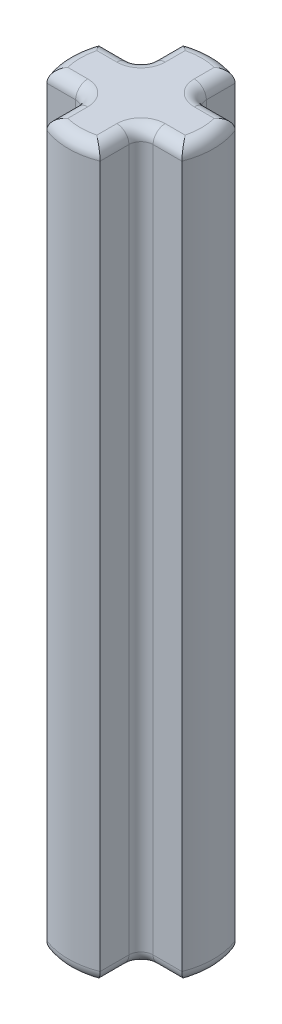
ISO-10303-21;
HEADER;
FILE_DESCRIPTION(('STEP AP214'),'2;1');
FILE_NAME('part.step','',(''),(''),'','','');
FILE_SCHEMA(('AUTOMOTIVE_DESIGN { 1 0 10303 214 1 1 1 1 }'));
ENDSEC;
DATA;
#1=APPLICATION_CONTEXT('core data for automotive mechanical design processes');
#2=APPLICATION_PROTOCOL_DEFINITION('international standard','automotive_design',2000,#1);
#3=PRODUCT_CONTEXT('',#1,'mechanical');
#4=PRODUCT('Part','Part','',(#3));
#5=PRODUCT_RELATED_PRODUCT_CATEGORY('part','',(#4));
#6=PRODUCT_DEFINITION_FORMATION('','',#4);
#7=PRODUCT_DEFINITION_CONTEXT('part definition',#1,'design');
#8=PRODUCT_DEFINITION('design','',#6,#7);
#9=PRODUCT_DEFINITION_SHAPE('','',#8);
#10=(LENGTH_UNIT() NAMED_UNIT(*) SI_UNIT(.MILLI.,.METRE.));
#11=(NAMED_UNIT(*) PLANE_ANGLE_UNIT() SI_UNIT($,.RADIAN.));
#12=(NAMED_UNIT(*) SI_UNIT($,.STERADIAN.) SOLID_ANGLE_UNIT());
#13=UNCERTAINTY_MEASURE_WITH_UNIT(LENGTH_MEASURE(1.E-05),#10,'distance_accuracy_value','');
#14=(GEOMETRIC_REPRESENTATION_CONTEXT(3) GLOBAL_UNCERTAINTY_ASSIGNED_CONTEXT((#13)) GLOBAL_UNIT_ASSIGNED_CONTEXT((#10,
#11,#12)) REPRESENTATION_CONTEXT('',''));
#15=CARTESIAN_POINT('',(0.,0.,0.));
#16=DIRECTION('',(0.,0.,1.));
#17=DIRECTION('',(1.,0.,0.));
#18=AXIS2_PLACEMENT_3D('',#15,#16,#17);
#19=CARTESIAN_POINT('',(0.,0.,0.));
#20=DIRECTION('',(0.,1.,0.));
#21=DIRECTION('',(0.,0.,1.));
#22=AXIS2_PLACEMENT_3D('',#19,#20,#21);
#23=PLANE('',#22);
#24=CARTESIAN_POINT('',(-1.28,0.,1.28));
#25=DIRECTION('',(0.,1.,0.));
#26=DIRECTION('',(0.,0.,1.));
#27=AXIS2_PLACEMENT_3D('',#24,#25,#26);
#28=CIRCLE('',#27,0.8);
#29=CARTESIAN_POINT('',(-1.28,0.,0.480000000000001));
#30=VERTEX_POINT('',#29);
#31=CARTESIAN_POINT('',(-0.48,0.,1.28));
#32=VERTEX_POINT('',#31);
#33=EDGE_CURVE('E266',#30,#32,#28,.F.);
#34=ORIENTED_EDGE('',*,*,#33,.F.);
#35=DIRECTION('',(1.,0.,0.));
#36=VECTOR('',#35,1.);
#37=CARTESIAN_POINT('',(0.,0.,0.480000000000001));
#38=LINE('',#37,#36);
#39=CARTESIAN_POINT('',(-1.94154577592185,0.,0.480000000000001));
#40=VERTEX_POINT('',#39);
#41=EDGE_CURVE('E347',#30,#40,#38,.F.);
#42=ORIENTED_EDGE('',*,*,#41,.T.);
#43=CARTESIAN_POINT('',(0.,0.,0.));
#44=DIRECTION('',(0.,1.,0.));
#45=DIRECTION('',(0.,0.,1.));
#46=AXIS2_PLACEMENT_3D('',#43,#44,#45);
#47=CIRCLE('',#46,2.);
#48=CARTESIAN_POINT('',(-1.94154577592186,0.,-0.48));
#49=VERTEX_POINT('',#48);
#50=EDGE_CURVE('E331',#40,#49,#47,.F.);
#51=ORIENTED_EDGE('',*,*,#50,.T.);
#52=DIRECTION('',(-1.,0.,0.));
#53=VECTOR('',#52,1.);
#54=CARTESIAN_POINT('',(0.,0.,-0.48));
#55=LINE('',#54,#53);
#56=CARTESIAN_POINT('',(-1.28,0.,-0.48));
#57=VERTEX_POINT('',#56);
#58=EDGE_CURVE('E314',#49,#57,#55,.F.);
#59=ORIENTED_EDGE('',*,*,#58,.T.);
#60=CARTESIAN_POINT('',(-1.28,0.,-1.28));
#61=DIRECTION('',(0.,1.,0.));
#62=DIRECTION('',(0.,0.,1.));
#63=AXIS2_PLACEMENT_3D('',#60,#61,#62);
#64=CIRCLE('',#63,0.8);
#65=CARTESIAN_POINT('',(-0.48,0.,-1.28));
#66=VERTEX_POINT('',#65);
#67=EDGE_CURVE('E310',#66,#57,#64,.F.);
#68=ORIENTED_EDGE('',*,*,#67,.F.);
#69=DIRECTION('',(0.,0.,1.));
#70=VECTOR('',#69,1.);
#71=CARTESIAN_POINT('',(-0.48,0.,0.));
#72=LINE('',#71,#70);
#73=CARTESIAN_POINT('',(-0.48,0.,-1.94154577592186));
#74=VERTEX_POINT('',#73);
#75=EDGE_CURVE('E298',#66,#74,#72,.F.);
#76=ORIENTED_EDGE('',*,*,#75,.T.);
#77=CARTESIAN_POINT('',(0.,0.,0.));
#78=DIRECTION('',(0.,1.,0.));
#79=DIRECTION('',(0.,0.,1.));
#80=AXIS2_PLACEMENT_3D('',#77,#78,#79);
#81=CIRCLE('',#80,2.);
#82=CARTESIAN_POINT('',(0.480000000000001,0.,-1.94154577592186));
#83=VERTEX_POINT('',#82);
#84=EDGE_CURVE('E304',#74,#83,#81,.F.);
#85=ORIENTED_EDGE('',*,*,#84,.T.);
#86=DIRECTION('',(0.,0.,-1.));
#87=VECTOR('',#86,1.);
#88=CARTESIAN_POINT('',(0.480000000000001,0.,0.));
#89=LINE('',#88,#87);
#90=CARTESIAN_POINT('',(0.480000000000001,0.,-1.28));
#91=VERTEX_POINT('',#90);
#92=EDGE_CURVE('E307',#83,#91,#89,.F.);
#93=ORIENTED_EDGE('',*,*,#92,.T.);
#94=CARTESIAN_POINT('',(1.28,0.,-1.28));
#95=DIRECTION('',(0.,1.,0.));
#96=DIRECTION('',(0.,0.,1.));
#97=AXIS2_PLACEMENT_3D('',#94,#95,#96);
#98=CIRCLE('',#97,0.8);
#99=CARTESIAN_POINT('',(1.28,0.,-0.48));
#100=VERTEX_POINT('',#99);
#101=EDGE_CURVE('E318',#100,#91,#98,.F.);
#102=ORIENTED_EDGE('',*,*,#101,.F.);
#103=DIRECTION('',(-1.,0.,0.));
#104=VECTOR('',#103,1.);
#105=CARTESIAN_POINT('',(0.,0.,-0.48));
#106=LINE('',#105,#104);
#107=CARTESIAN_POINT('',(1.94154577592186,0.,-0.48));
#108=VERTEX_POINT('',#107);
#109=EDGE_CURVE('E322',#100,#108,#106,.F.);
#110=ORIENTED_EDGE('',*,*,#109,.T.);
#111=CARTESIAN_POINT('',(0.,0.,0.));
#112=DIRECTION('',(0.,1.,0.));
#113=DIRECTION('',(0.,0.,1.));
#114=AXIS2_PLACEMENT_3D('',#111,#112,#113);
#115=CIRCLE('',#114,2.);
#116=CARTESIAN_POINT('',(1.94154577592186,0.,0.480000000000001));
#117=VERTEX_POINT('',#116);
#118=EDGE_CURVE('E325',#108,#117,#115,.F.);
#119=ORIENTED_EDGE('',*,*,#118,.T.);
#120=DIRECTION('',(1.,0.,0.));
#121=VECTOR('',#120,1.);
#122=CARTESIAN_POINT('',(0.,0.,0.480000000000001));
#123=LINE('',#122,#121);
#124=CARTESIAN_POINT('',(1.28,0.,0.480000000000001));
#125=VERTEX_POINT('',#124);
#126=EDGE_CURVE('E328',#117,#125,#123,.F.);
#127=ORIENTED_EDGE('',*,*,#126,.T.);
#128=CARTESIAN_POINT('',(1.28,0.,1.28));
#129=DIRECTION('',(0.,1.,0.));
#130=DIRECTION('',(0.,0.,1.));
#131=AXIS2_PLACEMENT_3D('',#128,#129,#130);
#132=CIRCLE('',#131,0.8);
#133=CARTESIAN_POINT('',(0.480000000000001,0.,1.28));
#134=VERTEX_POINT('',#133);
#135=EDGE_CURVE('E334',#134,#125,#132,.F.);
#136=ORIENTED_EDGE('',*,*,#135,.F.);
#137=DIRECTION('',(0.,0.,-1.));
#138=VECTOR('',#137,1.);
#139=CARTESIAN_POINT('',(0.480000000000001,0.,0.));
#140=LINE('',#139,#138);
#141=CARTESIAN_POINT('',(0.480000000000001,0.,1.94154577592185));
#142=VERTEX_POINT('',#141);
#143=EDGE_CURVE('E338',#134,#142,#140,.F.);
#144=ORIENTED_EDGE('',*,*,#143,.T.);
#145=CARTESIAN_POINT('',(0.,0.,0.));
#146=DIRECTION('',(0.,1.,0.));
#147=DIRECTION('',(0.,0.,1.));
#148=AXIS2_PLACEMENT_3D('',#145,#146,#147);
#149=CIRCLE('',#148,2.);
#150=CARTESIAN_POINT('',(-0.48,0.,1.94154577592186));
#151=VERTEX_POINT('',#150);
#152=EDGE_CURVE('E341',#142,#151,#149,.F.);
#153=ORIENTED_EDGE('',*,*,#152,.T.);
#154=DIRECTION('',(0.,0.,1.));
#155=VECTOR('',#154,1.);
#156=CARTESIAN_POINT('',(-0.48,0.,0.));
#157=LINE('',#156,#155);
#158=EDGE_CURVE('E344',#151,#32,#157,.F.);
#159=ORIENTED_EDGE('',*,*,#158,.T.);
#160=EDGE_LOOP('',(#34,#42,#51,#59,#68,#76,#85,#93,#102,#110,#119,#127,#136,#144,#153,#159));
#161=FACE_BOUND('',#160,.T.);
#162=ADVANCED_FACE('F38',(#161),#23,.F.);
#163=CARTESIAN_POINT('',(-0.88,24.,-2.23284571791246));
#164=DIRECTION('',(1.,0.,0.));
#165=DIRECTION('',(0.,0.,-1.));
#166=AXIS2_PLACEMENT_3D('',#163,#164,#165);
#167=PLANE('',#166);
#168=DIRECTION('',(0.,-1.,0.));
#169=VECTOR('',#168,1.);
#170=CARTESIAN_POINT('',(-0.88,24.,-2.23284571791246));
#171=LINE('',#170,#169);
#172=CARTESIAN_POINT('',(-0.88,23.6,-2.23284571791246));
#173=VERTEX_POINT('',#172);
#174=CARTESIAN_POINT('',(-0.88,0.400000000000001,-2.23284571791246));
#175=VERTEX_POINT('',#174);
#176=EDGE_CURVE('E771',#173,#175,#171,.T.);
#177=ORIENTED_EDGE('',*,*,#176,.T.);
#178=DIRECTION('',(0.,0.,1.));
#179=VECTOR('',#178,1.);
#180=CARTESIAN_POINT('',(-0.88,0.400000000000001,-2.23284571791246));
#181=LINE('',#180,#179);
#182=CARTESIAN_POINT('',(-0.88,0.400000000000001,-1.28));
#183=VERTEX_POINT('',#182);
#184=EDGE_CURVE('E436',#175,#183,#181,.T.);
#185=ORIENTED_EDGE('',*,*,#184,.T.);
#186=DIRECTION('',(0.,-1.,0.));
#187=VECTOR('',#186,1.);
#188=CARTESIAN_POINT('',(-0.88,24.,-1.28));
#189=LINE('',#188,#187);
#190=CARTESIAN_POINT('',(-0.88,23.6,-1.28));
#191=VERTEX_POINT('',#190);
#192=EDGE_CURVE('E430',#183,#191,#189,.F.);
#193=ORIENTED_EDGE('',*,*,#192,.T.);
#194=DIRECTION('',(0.,0.,1.));
#195=VECTOR('',#194,1.);
#196=CARTESIAN_POINT('',(-0.88,23.6,-2.23284571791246));
#197=LINE('',#196,#195);
#198=EDGE_CURVE('E433',#191,#173,#197,.F.);
#199=ORIENTED_EDGE('',*,*,#198,.T.);
#200=EDGE_LOOP('',(#177,#185,#193,#199));
#201=FACE_BOUND('',#200,.T.);
#202=ADVANCED_FACE('F878',(#201),#167,.F.);
#203=CARTESIAN_POINT('',(-2.23284571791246,24.,-0.88));
#204=DIRECTION('',(0.,0.,1.));
#205=DIRECTION('',(1.,0.,0.));
#206=AXIS2_PLACEMENT_3D('',#203,#204,#205);
#207=PLANE('',#206);
#208=DIRECTION('',(0.,-1.,0.));
#209=VECTOR('',#208,1.);
#210=CARTESIAN_POINT('',(-1.28,0.,-0.88));
#211=LINE('',#210,#209);
#212=CARTESIAN_POINT('',(-1.28,23.6,-0.88));
#213=VERTEX_POINT('',#212);
#214=CARTESIAN_POINT('',(-1.28,0.400000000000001,-0.88));
#215=VERTEX_POINT('',#214);
#216=EDGE_CURVE('E277',#213,#215,#211,.T.);
#217=ORIENTED_EDGE('',*,*,#216,.T.);
#218=DIRECTION('',(-1.,0.,0.));
#219=VECTOR('',#218,1.);
#220=CARTESIAN_POINT('',(-2.23284571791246,0.400000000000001,-0.88));
#221=LINE('',#220,#219);
#222=CARTESIAN_POINT('',(-2.23284571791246,0.400000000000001,-0.88));
#223=VERTEX_POINT('',#222);
#224=EDGE_CURVE('E275',#215,#223,#221,.T.);
#225=ORIENTED_EDGE('',*,*,#224,.T.);
#226=DIRECTION('',(0.,-1.,0.));
#227=VECTOR('',#226,1.);
#228=CARTESIAN_POINT('',(-2.23284571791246,24.,-0.88));
#229=LINE('',#228,#227);
#230=CARTESIAN_POINT('',(-2.23284571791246,23.6,-0.88));
#231=VERTEX_POINT('',#230);
#232=EDGE_CURVE('E257',#231,#223,#229,.T.);
#233=ORIENTED_EDGE('',*,*,#232,.F.);
#234=DIRECTION('',(-1.,0.,0.));
#235=VECTOR('',#234,1.);
#236=CARTESIAN_POINT('',(-0.88,23.6,-0.88));
#237=LINE('',#236,#235);
#238=EDGE_CURVE('E272',#231,#213,#237,.F.);
#239=ORIENTED_EDGE('',*,*,#238,.T.);
#240=EDGE_LOOP('',(#217,#225,#233,#239));
#241=FACE_BOUND('',#240,.T.);
#242=ADVANCED_FACE('F270',(#241),#207,.F.);
#243=CARTESIAN_POINT('',(0.,24.,0.));
#244=DIRECTION('',(0.,-1.,0.));
#245=DIRECTION('',(0.,0.,-1.));
#246=AXIS2_PLACEMENT_3D('',#243,#244,#245);
#247=CYLINDRICAL_SURFACE('',#246,2.4);
#248=ORIENTED_EDGE('',*,*,#232,.T.);
#249=CARTESIAN_POINT('',(0.,0.400000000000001,0.));
#250=DIRECTION('',(0.,1.,0.));
#251=DIRECTION('',(0.,0.,1.));
#252=AXIS2_PLACEMENT_3D('',#249,#250,#251);
#253=CIRCLE('',#252,2.4);
#254=CARTESIAN_POINT('',(-2.23284571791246,0.400000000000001,0.880000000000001));
#255=VERTEX_POINT('',#254);
#256=EDGE_CURVE('E265',#223,#255,#253,.T.);
#257=ORIENTED_EDGE('',*,*,#256,.T.);
#258=DIRECTION('',(0.,-1.,0.));
#259=VECTOR('',#258,1.);
#260=CARTESIAN_POINT('',(-2.23284571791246,24.,0.880000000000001));
#261=LINE('',#260,#259);
#262=CARTESIAN_POINT('',(-2.23284571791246,23.6,0.880000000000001));
#263=VERTEX_POINT('',#262);
#264=EDGE_CURVE('E259',#263,#255,#261,.T.);
#265=ORIENTED_EDGE('',*,*,#264,.F.);
#266=CARTESIAN_POINT('',(0.,23.6,0.));
#267=DIRECTION('',(0.,1.,0.));
#268=DIRECTION('',(0.,0.,1.));
#269=AXIS2_PLACEMENT_3D('',#266,#267,#268);
#270=CIRCLE('',#269,2.4);
#271=EDGE_CURVE('E254',#263,#231,#270,.F.);
#272=ORIENTED_EDGE('',*,*,#271,.T.);
#273=EDGE_LOOP('',(#248,#257,#265,#272));
#274=FACE_BOUND('',#273,.T.);
#275=ADVANCED_FACE('F256',(#274),#247,.T.);
#276=CARTESIAN_POINT('',(-0.88,24.,0.880000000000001));
#277=DIRECTION('',(0.,0.,-1.));
#278=DIRECTION('',(-1.,0.,0.));
#279=AXIS2_PLACEMENT_3D('',#276,#277,#278);
#280=PLANE('',#279);
#281=ORIENTED_EDGE('',*,*,#264,.T.);
#282=DIRECTION('',(1.,0.,0.));
#283=VECTOR('',#282,1.);
#284=CARTESIAN_POINT('',(-0.88,0.400000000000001,0.880000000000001));
#285=LINE('',#284,#283);
#286=CARTESIAN_POINT('',(-1.28,0.400000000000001,0.880000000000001));
#287=VERTEX_POINT('',#286);
#288=EDGE_CURVE('E361',#255,#287,#285,.T.);
#289=ORIENTED_EDGE('',*,*,#288,.T.);
#290=DIRECTION('',(0.,-1.,0.));
#291=VECTOR('',#290,1.);
#292=CARTESIAN_POINT('',(-1.28,24.,0.880000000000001));
#293=LINE('',#292,#291);
#294=CARTESIAN_POINT('',(-1.28,23.6,0.880000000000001));
#295=VERTEX_POINT('',#294);
#296=EDGE_CURVE('E355',#287,#295,#293,.F.);
#297=ORIENTED_EDGE('',*,*,#296,.T.);
#298=DIRECTION('',(1.,0.,0.));
#299=VECTOR('',#298,1.);
#300=CARTESIAN_POINT('',(-2.23284571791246,23.6,0.880000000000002));
#301=LINE('',#300,#299);
#302=EDGE_CURVE('E358',#295,#263,#301,.F.);
#303=ORIENTED_EDGE('',*,*,#302,.T.);
#304=EDGE_LOOP('',(#281,#289,#297,#303));
#305=FACE_BOUND('',#304,.T.);
#306=ADVANCED_FACE('F804',(#305),#280,.F.);
#307=CARTESIAN_POINT('',(-0.88,24.,0.880000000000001));
#308=DIRECTION('',(1.,0.,0.));
#309=DIRECTION('',(0.,0.,-1.));
#310=AXIS2_PLACEMENT_3D('',#307,#308,#309);
#311=PLANE('',#310);
#312=DIRECTION('',(0.,-1.,0.));
#313=VECTOR('',#312,1.);
#314=CARTESIAN_POINT('',(-0.88,0.,1.28));
#315=LINE('',#314,#313);
#316=CARTESIAN_POINT('',(-0.88,23.6,1.28));
#317=VERTEX_POINT('',#316);
#318=CARTESIAN_POINT('',(-0.88,0.400000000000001,1.28));
#319=VERTEX_POINT('',#318);
#320=EDGE_CURVE('E364',#317,#319,#315,.T.);
#321=ORIENTED_EDGE('',*,*,#320,.T.);
#322=DIRECTION('',(0.,0.,1.));
#323=VECTOR('',#322,1.);
#324=CARTESIAN_POINT('',(-0.88,0.400000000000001,0.880000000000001));
#325=LINE('',#324,#323);
#326=CARTESIAN_POINT('',(-0.88,0.400000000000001,2.23284571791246));
#327=VERTEX_POINT('',#326);
#328=EDGE_CURVE('E370',#319,#327,#325,.T.);
#329=ORIENTED_EDGE('',*,*,#328,.T.);
#330=DIRECTION('',(0.,-1.,0.));
#331=VECTOR('',#330,1.);
#332=CARTESIAN_POINT('',(-0.88,24.,2.23284571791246));
#333=LINE('',#332,#331);
#334=CARTESIAN_POINT('',(-0.88,23.6,2.23284571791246));
#335=VERTEX_POINT('',#334);
#336=EDGE_CURVE('E797',#335,#327,#333,.T.);
#337=ORIENTED_EDGE('',*,*,#336,.F.);
#338=DIRECTION('',(0.,0.,1.));
#339=VECTOR('',#338,1.);
#340=CARTESIAN_POINT('',(-0.88,23.6,0.880000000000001));
#341=LINE('',#340,#339);
#342=EDGE_CURVE('E367',#335,#317,#341,.F.);
#343=ORIENTED_EDGE('',*,*,#342,.T.);
#344=EDGE_LOOP('',(#321,#329,#337,#343));
#345=FACE_BOUND('',#344,.T.);
#346=ADVANCED_FACE('F909',(#345),#311,.F.);
#347=CARTESIAN_POINT('',(0.,24.,0.));
#348=DIRECTION('',(0.,-1.,0.));
#349=DIRECTION('',(0.,0.,-1.));
#350=AXIS2_PLACEMENT_3D('',#347,#348,#349);
#351=CYLINDRICAL_SURFACE('',#350,2.4);
#352=ORIENTED_EDGE('',*,*,#336,.T.);
#353=CARTESIAN_POINT('',(0.,0.400000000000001,0.));
#354=DIRECTION('',(0.,1.,0.));
#355=DIRECTION('',(0.,0.,1.));
#356=AXIS2_PLACEMENT_3D('',#353,#354,#355);
#357=CIRCLE('',#356,2.4);
#358=CARTESIAN_POINT('',(0.88,0.400000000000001,2.23284571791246));
#359=VERTEX_POINT('',#358);
#360=EDGE_CURVE('E377',#327,#359,#357,.T.);
#361=ORIENTED_EDGE('',*,*,#360,.T.);
#362=DIRECTION('',(0.,-1.,0.));
#363=VECTOR('',#362,1.);
#364=CARTESIAN_POINT('',(0.88,24.,2.23284571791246));
#365=LINE('',#364,#363);
#366=CARTESIAN_POINT('',(0.88,23.6,2.23284571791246));
#367=VERTEX_POINT('',#366);
#368=EDGE_CURVE('E793',#367,#359,#365,.T.);
#369=ORIENTED_EDGE('',*,*,#368,.F.);
#370=CARTESIAN_POINT('',(0.,23.6,0.));
#371=DIRECTION('',(0.,1.,0.));
#372=DIRECTION('',(0.,0.,1.));
#373=AXIS2_PLACEMENT_3D('',#370,#371,#372);
#374=CIRCLE('',#373,2.4);
#375=EDGE_CURVE('E374',#367,#335,#374,.F.);
#376=ORIENTED_EDGE('',*,*,#375,.T.);
#377=EDGE_LOOP('',(#352,#361,#369,#376));
#378=FACE_BOUND('',#377,.T.);
#379=ADVANCED_FACE('F905',(#378),#351,.T.);
#380=CARTESIAN_POINT('',(0.880000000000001,24.,2.23284571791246));
#381=DIRECTION('',(-1.,0.,0.));
#382=DIRECTION('',(0.,0.,1.));
#383=AXIS2_PLACEMENT_3D('',#380,#381,#382);
#384=PLANE('',#383);
#385=ORIENTED_EDGE('',*,*,#368,.T.);
#386=DIRECTION('',(0.,0.,-1.));
#387=VECTOR('',#386,1.);
#388=CARTESIAN_POINT('',(0.880000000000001,0.400000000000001,2.23284571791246));
#389=LINE('',#388,#387);
#390=CARTESIAN_POINT('',(0.880000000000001,0.400000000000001,1.28));
#391=VERTEX_POINT('',#390);
#392=EDGE_CURVE('E386',#359,#391,#389,.T.);
#393=ORIENTED_EDGE('',*,*,#392,.T.);
#394=DIRECTION('',(0.,-1.,0.));
#395=VECTOR('',#394,1.);
#396=CARTESIAN_POINT('',(0.880000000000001,24.,1.28));
#397=LINE('',#396,#395);
#398=CARTESIAN_POINT('',(0.880000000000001,23.6,1.28));
#399=VERTEX_POINT('',#398);
#400=EDGE_CURVE('E380',#391,#399,#397,.F.);
#401=ORIENTED_EDGE('',*,*,#400,.T.);
#402=DIRECTION('',(0.,0.,-1.));
#403=VECTOR('',#402,1.);
#404=CARTESIAN_POINT('',(0.880000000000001,23.6,2.23284571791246));
#405=LINE('',#404,#403);
#406=EDGE_CURVE('E383',#399,#367,#405,.F.);
#407=ORIENTED_EDGE('',*,*,#406,.T.);
#408=EDGE_LOOP('',(#385,#393,#401,#407));
#409=FACE_BOUND('',#408,.T.);
#410=ADVANCED_FACE('F901',(#409),#384,.F.);
#411=CARTESIAN_POINT('',(2.23284571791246,24.,0.880000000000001));
#412=DIRECTION('',(0.,0.,-1.));
#413=DIRECTION('',(-1.,0.,0.));
#414=AXIS2_PLACEMENT_3D('',#411,#412,#413);
#415=PLANE('',#414);
#416=DIRECTION('',(0.,-1.,0.));
#417=VECTOR('',#416,1.);
#418=CARTESIAN_POINT('',(1.28,0.,0.880000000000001));
#419=LINE('',#418,#417);
#420=CARTESIAN_POINT('',(1.28,23.6,0.880000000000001));
#421=VERTEX_POINT('',#420);
#422=CARTESIAN_POINT('',(1.28,0.400000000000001,0.880000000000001));
#423=VERTEX_POINT('',#422);
#424=EDGE_CURVE('E389',#421,#423,#419,.T.);
#425=ORIENTED_EDGE('',*,*,#424,.T.);
#426=DIRECTION('',(1.,0.,0.));
#427=VECTOR('',#426,1.);
#428=CARTESIAN_POINT('',(2.23284571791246,0.400000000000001,0.880000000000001));
#429=LINE('',#428,#427);
#430=CARTESIAN_POINT('',(2.23284571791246,0.400000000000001,0.880000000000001));
#431=VERTEX_POINT('',#430);
#432=EDGE_CURVE('E395',#423,#431,#429,.T.);
#433=ORIENTED_EDGE('',*,*,#432,.T.);
#434=DIRECTION('',(0.,-1.,0.));
#435=VECTOR('',#434,1.);
#436=CARTESIAN_POINT('',(2.23284571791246,24.,0.880000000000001));
#437=LINE('',#436,#435);
#438=CARTESIAN_POINT('',(2.23284571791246,23.6,0.880000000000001));
#439=VERTEX_POINT('',#438);
#440=EDGE_CURVE('E789',#439,#431,#437,.T.);
#441=ORIENTED_EDGE('',*,*,#440,.F.);
#442=DIRECTION('',(1.,0.,0.));
#443=VECTOR('',#442,1.);
#444=CARTESIAN_POINT('',(0.880000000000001,23.6,0.880000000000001));
#445=LINE('',#444,#443);
#446=EDGE_CURVE('E392',#439,#421,#445,.F.);
#447=ORIENTED_EDGE('',*,*,#446,.T.);
#448=EDGE_LOOP('',(#425,#433,#441,#447));
#449=FACE_BOUND('',#448,.T.);
#450=ADVANCED_FACE('F897',(#449),#415,.F.);
#451=CARTESIAN_POINT('',(0.,24.,0.));
#452=DIRECTION('',(0.,-1.,0.));
#453=DIRECTION('',(0.,0.,-1.));
#454=AXIS2_PLACEMENT_3D('',#451,#452,#453);
#455=CYLINDRICAL_SURFACE('',#454,2.4);
#456=ORIENTED_EDGE('',*,*,#440,.T.);
#457=CARTESIAN_POINT('',(0.,0.400000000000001,0.));
#458=DIRECTION('',(0.,1.,0.));
#459=DIRECTION('',(0.,0.,1.));
#460=AXIS2_PLACEMENT_3D('',#457,#458,#459);
#461=CIRCLE('',#460,2.4);
#462=CARTESIAN_POINT('',(2.23284571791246,0.400000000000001,-0.88));
#463=VERTEX_POINT('',#462);
#464=EDGE_CURVE('E402',#431,#463,#461,.T.);
#465=ORIENTED_EDGE('',*,*,#464,.T.);
#466=DIRECTION('',(0.,-1.,0.));
#467=VECTOR('',#466,1.);
#468=CARTESIAN_POINT('',(2.23284571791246,24.,-0.88));
#469=LINE('',#468,#467);
#470=CARTESIAN_POINT('',(2.23284571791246,23.6,-0.88));
#471=VERTEX_POINT('',#470);
#472=EDGE_CURVE('E783',#471,#463,#469,.T.);
#473=ORIENTED_EDGE('',*,*,#472,.F.);
#474=CARTESIAN_POINT('',(0.,23.6,0.));
#475=DIRECTION('',(0.,1.,0.));
#476=DIRECTION('',(0.,0.,1.));
#477=AXIS2_PLACEMENT_3D('',#474,#475,#476);
#478=CIRCLE('',#477,2.4);
#479=EDGE_CURVE('E399',#471,#439,#478,.F.);
#480=ORIENTED_EDGE('',*,*,#479,.T.);
#481=EDGE_LOOP('',(#456,#465,#473,#480));
#482=FACE_BOUND('',#481,.T.);
#483=ADVANCED_FACE('F893',(#482),#455,.T.);
#484=CARTESIAN_POINT('',(0.880000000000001,24.,-0.88));
#485=DIRECTION('',(0.,0.,1.));
#486=DIRECTION('',(1.,0.,0.));
#487=AXIS2_PLACEMENT_3D('',#484,#485,#486);
#488=PLANE('',#487);
#489=ORIENTED_EDGE('',*,*,#472,.T.);
#490=DIRECTION('',(-1.,0.,0.));
#491=VECTOR('',#490,1.);
#492=CARTESIAN_POINT('',(0.880000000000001,0.400000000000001,-0.88));
#493=LINE('',#492,#491);
#494=CARTESIAN_POINT('',(1.28,0.400000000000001,-0.88));
#495=VERTEX_POINT('',#494);
#496=EDGE_CURVE('E411',#463,#495,#493,.T.);
#497=ORIENTED_EDGE('',*,*,#496,.T.);
#498=DIRECTION('',(0.,-1.,0.));
#499=VECTOR('',#498,1.);
#500=CARTESIAN_POINT('',(1.28,24.,-0.88));
#501=LINE('',#500,#499);
#502=CARTESIAN_POINT('',(1.28,23.6,-0.88));
#503=VERTEX_POINT('',#502);
#504=EDGE_CURVE('E405',#495,#503,#501,.F.);
#505=ORIENTED_EDGE('',*,*,#504,.T.);
#506=DIRECTION('',(-1.,0.,0.));
#507=VECTOR('',#506,1.);
#508=CARTESIAN_POINT('',(2.23284571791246,23.6,-0.88));
#509=LINE('',#508,#507);
#510=EDGE_CURVE('E408',#503,#471,#509,.F.);
#511=ORIENTED_EDGE('',*,*,#510,.T.);
#512=EDGE_LOOP('',(#489,#497,#505,#511));
#513=FACE_BOUND('',#512,.T.);
#514=ADVANCED_FACE('F890',(#513),#488,.F.);
#515=CARTESIAN_POINT('',(0.880000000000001,24.,-0.88));
#516=DIRECTION('',(-1.,0.,0.));
#517=DIRECTION('',(0.,0.,1.));
#518=AXIS2_PLACEMENT_3D('',#515,#516,#517);
#519=PLANE('',#518);
#520=DIRECTION('',(0.,-1.,0.));
#521=VECTOR('',#520,1.);
#522=CARTESIAN_POINT('',(0.880000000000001,0.,-1.28));
#523=LINE('',#522,#521);
#524=CARTESIAN_POINT('',(0.880000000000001,23.6,-1.28));
#525=VERTEX_POINT('',#524);
#526=CARTESIAN_POINT('',(0.880000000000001,0.400000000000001,-1.28));
#527=VERTEX_POINT('',#526);
#528=EDGE_CURVE('E414',#525,#527,#523,.T.);
#529=ORIENTED_EDGE('',*,*,#528,.T.);
#530=DIRECTION('',(0.,0.,-1.));
#531=VECTOR('',#530,1.);
#532=CARTESIAN_POINT('',(0.880000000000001,0.400000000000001,-0.88));
#533=LINE('',#532,#531);
#534=CARTESIAN_POINT('',(0.880000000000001,0.400000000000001,-2.23284571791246));
#535=VERTEX_POINT('',#534);
#536=EDGE_CURVE('E420',#527,#535,#533,.T.);
#537=ORIENTED_EDGE('',*,*,#536,.T.);
#538=DIRECTION('',(0.,-1.,0.));
#539=VECTOR('',#538,1.);
#540=CARTESIAN_POINT('',(0.880000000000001,24.,-2.23284571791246));
#541=LINE('',#540,#539);
#542=CARTESIAN_POINT('',(0.880000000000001,23.6,-2.23284571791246));
#543=VERTEX_POINT('',#542);
#544=EDGE_CURVE('E776',#543,#535,#541,.T.);
#545=ORIENTED_EDGE('',*,*,#544,.F.);
#546=DIRECTION('',(0.,0.,-1.));
#547=VECTOR('',#546,1.);
#548=CARTESIAN_POINT('',(0.880000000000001,23.6,-0.88));
#549=LINE('',#548,#547);
#550=EDGE_CURVE('E417',#543,#525,#549,.F.);
#551=ORIENTED_EDGE('',*,*,#550,.T.);
#552=EDGE_LOOP('',(#529,#537,#545,#551));
#553=FACE_BOUND('',#552,.T.);
#554=ADVANCED_FACE('F825',(#553),#519,.F.);
#555=CARTESIAN_POINT('',(0.,24.,0.));
#556=DIRECTION('',(0.,-1.,0.));
#557=DIRECTION('',(0.,0.,-1.));
#558=AXIS2_PLACEMENT_3D('',#555,#556,#557);
#559=CYLINDRICAL_SURFACE('',#558,2.4);
#560=ORIENTED_EDGE('',*,*,#544,.T.);
#561=CARTESIAN_POINT('',(0.,0.400000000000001,0.));
#562=DIRECTION('',(0.,1.,0.));
#563=DIRECTION('',(0.,0.,1.));
#564=AXIS2_PLACEMENT_3D('',#561,#562,#563);
#565=CIRCLE('',#564,2.4);
#566=EDGE_CURVE('E427',#535,#175,#565,.T.);
#567=ORIENTED_EDGE('',*,*,#566,.T.);
#568=ORIENTED_EDGE('',*,*,#176,.F.);
#569=CARTESIAN_POINT('',(0.,23.6,0.));
#570=DIRECTION('',(0.,1.,0.));
#571=DIRECTION('',(0.,0.,1.));
#572=AXIS2_PLACEMENT_3D('',#569,#570,#571);
#573=CIRCLE('',#572,2.4);
#574=EDGE_CURVE('E424',#173,#543,#573,.F.);
#575=ORIENTED_EDGE('',*,*,#574,.T.);
#576=EDGE_LOOP('',(#560,#567,#568,#575));
#577=FACE_BOUND('',#576,.T.);
#578=ADVANCED_FACE('F829',(#577),#559,.T.);
#579=CARTESIAN_POINT('',(0.,24.,0.));
#580=DIRECTION('',(0.,1.,0.));
#581=DIRECTION('',(0.,0.,1.));
#582=AXIS2_PLACEMENT_3D('',#579,#580,#581);
#583=PLANE('',#582);
#584=CARTESIAN_POINT('',(0.,24.,0.));
#585=DIRECTION('',(0.,1.,0.));
#586=DIRECTION('',(0.,0.,1.));
#587=AXIS2_PLACEMENT_3D('',#584,#585,#586);
#588=CIRCLE('',#587,2.);
#589=CARTESIAN_POINT('',(1.94154577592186,24.,0.480000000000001));
#590=VERTEX_POINT('',#589);
#591=CARTESIAN_POINT('',(1.94154577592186,24.,-0.48));
#592=VERTEX_POINT('',#591);
#593=EDGE_CURVE('E65',#590,#592,#588,.T.);
#594=ORIENTED_EDGE('',*,*,#593,.T.);
#595=DIRECTION('',(-1.,0.,0.));
#596=VECTOR('',#595,1.);
#597=CARTESIAN_POINT('',(0.880000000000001,24.,-0.48));
#598=LINE('',#597,#596);
#599=CARTESIAN_POINT('',(1.28,24.,-0.48));
#600=VERTEX_POINT('',#599);
#601=EDGE_CURVE('E11',#592,#600,#598,.T.);
#602=ORIENTED_EDGE('',*,*,#601,.T.);
#603=CARTESIAN_POINT('',(1.28,24.,-1.28));
#604=DIRECTION('',(0.,1.,0.));
#605=DIRECTION('',(0.,0.,1.));
#606=AXIS2_PLACEMENT_3D('',#603,#604,#605);
#607=CIRCLE('',#606,0.8);
#608=CARTESIAN_POINT('',(0.480000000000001,24.,-1.28));
#609=VERTEX_POINT('',#608);
#610=EDGE_CURVE('E54',#609,#600,#607,.T.);
#611=ORIENTED_EDGE('',*,*,#610,.F.);
#612=DIRECTION('',(0.,0.,-1.));
#613=VECTOR('',#612,1.);
#614=CARTESIAN_POINT('',(0.480000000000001,24.,-2.23284571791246));
#615=LINE('',#614,#613);
#616=CARTESIAN_POINT('',(0.480000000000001,24.,-1.94154577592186));
#617=VERTEX_POINT('',#616);
#618=EDGE_CURVE('E471',#609,#617,#615,.T.);
#619=ORIENTED_EDGE('',*,*,#618,.T.);
#620=CARTESIAN_POINT('',(0.,24.,0.));
#621=DIRECTION('',(0.,1.,0.));
#622=DIRECTION('',(0.,0.,1.));
#623=AXIS2_PLACEMENT_3D('',#620,#621,#622);
#624=CIRCLE('',#623,2.);
#625=CARTESIAN_POINT('',(-0.48,24.,-1.94154577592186));
#626=VERTEX_POINT('',#625);
#627=EDGE_CURVE('E454',#617,#626,#624,.T.);
#628=ORIENTED_EDGE('',*,*,#627,.T.);
#629=DIRECTION('',(0.,0.,1.));
#630=VECTOR('',#629,1.);
#631=CARTESIAN_POINT('',(-0.48,24.,-0.88));
#632=LINE('',#631,#630);
#633=CARTESIAN_POINT('',(-0.48,24.,-1.28));
#634=VERTEX_POINT('',#633);
#635=EDGE_CURVE('E443',#626,#634,#632,.T.);
#636=ORIENTED_EDGE('',*,*,#635,.T.);
#637=CARTESIAN_POINT('',(-1.28,24.,-1.28));
#638=DIRECTION('',(0.,1.,0.));
#639=DIRECTION('',(0.,0.,1.));
#640=AXIS2_PLACEMENT_3D('',#637,#638,#639);
#641=CIRCLE('',#640,0.8);
#642=CARTESIAN_POINT('',(-1.28,24.,-0.48));
#643=VERTEX_POINT('',#642);
#644=EDGE_CURVE('E439',#643,#634,#641,.T.);
#645=ORIENTED_EDGE('',*,*,#644,.F.);
#646=DIRECTION('',(-1.,0.,0.));
#647=VECTOR('',#646,1.);
#648=CARTESIAN_POINT('',(-2.23284571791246,24.,-0.48));
#649=LINE('',#648,#647);
#650=CARTESIAN_POINT('',(-1.94154577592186,24.,-0.48));
#651=VERTEX_POINT('',#650);
#652=EDGE_CURVE('E446',#643,#651,#649,.T.);
#653=ORIENTED_EDGE('',*,*,#652,.T.);
#654=CARTESIAN_POINT('',(0.,24.,0.));
#655=DIRECTION('',(0.,1.,0.));
#656=DIRECTION('',(0.,0.,1.));
#657=AXIS2_PLACEMENT_3D('',#654,#655,#656);
#658=CIRCLE('',#657,2.);
#659=CARTESIAN_POINT('',(-1.94154577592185,24.,0.480000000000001));
#660=VERTEX_POINT('',#659);
#661=EDGE_CURVE('E283',#651,#660,#658,.T.);
#662=ORIENTED_EDGE('',*,*,#661,.T.);
#663=DIRECTION('',(1.,0.,0.));
#664=VECTOR('',#663,1.);
#665=CARTESIAN_POINT('',(-0.88,24.,0.480000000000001));
#666=LINE('',#665,#664);
#667=CARTESIAN_POINT('',(-1.28,24.,0.480000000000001));
#668=VERTEX_POINT('',#667);
#669=EDGE_CURVE('E451',#660,#668,#666,.T.);
#670=ORIENTED_EDGE('',*,*,#669,.T.);
#671=CARTESIAN_POINT('',(-1.28,24.,1.28));
#672=DIRECTION('',(0.,1.,0.));
#673=DIRECTION('',(0.,0.,1.));
#674=AXIS2_PLACEMENT_3D('',#671,#672,#673);
#675=CIRCLE('',#674,0.8);
#676=CARTESIAN_POINT('',(-0.48,24.,1.28));
#677=VERTEX_POINT('',#676);
#678=EDGE_CURVE('E458',#677,#668,#675,.T.);
#679=ORIENTED_EDGE('',*,*,#678,.F.);
#680=DIRECTION('',(0.,0.,1.));
#681=VECTOR('',#680,1.);
#682=CARTESIAN_POINT('',(-0.48,24.,2.23284571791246));
#683=LINE('',#682,#681);
#684=CARTESIAN_POINT('',(-0.48,24.,1.94154577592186));
#685=VERTEX_POINT('',#684);
#686=EDGE_CURVE('E462',#677,#685,#683,.T.);
#687=ORIENTED_EDGE('',*,*,#686,.T.);
#688=CARTESIAN_POINT('',(0.,24.,0.));
#689=DIRECTION('',(0.,1.,0.));
#690=DIRECTION('',(0.,0.,1.));
#691=AXIS2_PLACEMENT_3D('',#688,#689,#690);
#692=CIRCLE('',#691,2.);
#693=CARTESIAN_POINT('',(0.48,24.,1.94154577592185));
#694=VERTEX_POINT('',#693);
#695=EDGE_CURVE('E465',#685,#694,#692,.T.);
#696=ORIENTED_EDGE('',*,*,#695,.T.);
#697=DIRECTION('',(0.,0.,-1.));
#698=VECTOR('',#697,1.);
#699=CARTESIAN_POINT('',(0.480000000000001,24.,0.880000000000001));
#700=LINE('',#699,#698);
#701=CARTESIAN_POINT('',(0.480000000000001,24.,1.28));
#702=VERTEX_POINT('',#701);
#703=EDGE_CURVE('E468',#694,#702,#700,.T.);
#704=ORIENTED_EDGE('',*,*,#703,.T.);
#705=CARTESIAN_POINT('',(1.28,24.,1.28));
#706=DIRECTION('',(0.,1.,0.));
#707=DIRECTION('',(0.,0.,1.));
#708=AXIS2_PLACEMENT_3D('',#705,#706,#707);
#709=CIRCLE('',#708,0.8);
#710=CARTESIAN_POINT('',(1.28,24.,0.480000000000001));
#711=VERTEX_POINT('',#710);
#712=EDGE_CURVE('E474',#711,#702,#709,.T.);
#713=ORIENTED_EDGE('',*,*,#712,.F.);
#714=DIRECTION('',(1.,0.,0.));
#715=VECTOR('',#714,1.);
#716=CARTESIAN_POINT('',(2.23284571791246,24.,0.480000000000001));
#717=LINE('',#716,#715);
#718=EDGE_CURVE('E478',#711,#590,#717,.T.);
#719=ORIENTED_EDGE('',*,*,#718,.T.);
#720=EDGE_LOOP('',(#594,#602,#611,#619,#628,#636,#645,#653,#662,#670,#679,#687,#696,#704,#713,#719));
#721=FACE_BOUND('',#720,.T.);
#722=ADVANCED_FACE('F885',(#721),#583,.T.);
#723=CARTESIAN_POINT('',(0.,23.6,0.480000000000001));
#724=DIRECTION('',(-1.,0.,0.));
#725=DIRECTION('',(0.,0.,1.));
#726=AXIS2_PLACEMENT_3D('',#723,#724,#725);
#727=CYLINDRICAL_SURFACE('',#726,0.4);
#728=CARTESIAN_POINT('',(1.28,23.6,0.480000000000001));
#729=DIRECTION('',(-1.,0.,0.));
#730=DIRECTION('',(0.,0.,1.));
#731=AXIS2_PLACEMENT_3D('',#728,#729,#730);
#732=CIRCLE('',#731,0.4);
#733=EDGE_CURVE('E762',#421,#711,#732,.T.);
#734=ORIENTED_EDGE('',*,*,#733,.F.);
#735=ORIENTED_EDGE('',*,*,#446,.F.);
#736=CARTESIAN_POINT('',(2.23284571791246,23.6,0.880000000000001));
#737=CARTESIAN_POINT('',(2.23286229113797,23.6196677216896,0.880027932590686));
#738=CARTESIAN_POINT('',(2.23185960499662,23.6393093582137,0.878551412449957));
#739=CARTESIAN_POINT('',(2.22795221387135,23.6778900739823,0.872817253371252));
#740=CARTESIAN_POINT('',(2.22505712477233,23.6968321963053,0.86857367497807));
#741=CARTESIAN_POINT('',(2.21750324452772,23.7335523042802,0.85753531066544));
#742=CARTESIAN_POINT('',(2.21284643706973,23.7513315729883,0.850743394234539));
#743=CARTESIAN_POINT('',(2.20197052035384,23.7853742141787,0.834948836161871));
#744=CARTESIAN_POINT('',(2.19574983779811,23.8016360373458,0.825943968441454));
#745=CARTESIAN_POINT('',(2.18156387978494,23.8332696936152,0.805515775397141));
#746=CARTESIAN_POINT('',(2.1735174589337,23.8485327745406,0.793981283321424));
#747=CARTESIAN_POINT('',(2.15618491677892,23.8768786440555,0.769295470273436));
#748=CARTESIAN_POINT('',(2.14689846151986,23.8899608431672,0.756143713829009));
#749=CARTESIAN_POINT('',(2.12572929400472,23.9158258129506,0.72638021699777));
#750=CARTESIAN_POINT('',(2.11366981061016,23.9282155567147,0.709553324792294));
#751=CARTESIAN_POINT('',(2.08850314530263,23.9499832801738,0.674765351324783));
#752=CARTESIAN_POINT('',(2.07539489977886,23.9593581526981,0.656803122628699));
#753=CARTESIAN_POINT('',(2.04585046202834,23.9766538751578,0.616725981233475));
#754=CARTESIAN_POINT('',(2.02925334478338,23.9839655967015,0.594467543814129));
#755=CARTESIAN_POINT('',(1.99535297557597,23.9945738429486,0.549587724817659));
#756=CARTESIAN_POINT('',(1.97805064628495,23.9978754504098,0.526966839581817));
#757=CARTESIAN_POINT('',(1.95507409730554,23.9996873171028,0.497330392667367));
#758=CARTESIAN_POINT('',(1.94956846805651,23.9999307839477,0.490258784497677));
#759=CARTESIAN_POINT('',(1.94321386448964,23.9999957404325,0.482131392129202));
#760=CARTESIAN_POINT('',(1.94237999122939,23.9999999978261,0.481065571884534));
#761=CARTESIAN_POINT('',(1.94154577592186,24.,0.480000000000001));
#762=B_SPLINE_CURVE_WITH_KNOTS('',3,(#736,#737,#738,#739,#740,#741,#742,#743,#744,#745,#746,
#747,#748,#749,#750,#751,#752,#753,#754,#755,#756,#757,#758,#759,#760,#761),.UNSPECIFIED.,.F.,
.F.,(4,2,2,2,2,2,2,2,2,2,2,2,4),(0.,0.0588812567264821,0.117465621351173,0.175984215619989,
0.234561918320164,0.296588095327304,0.358631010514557,0.430741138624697,0.502925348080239,
0.588744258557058,0.674454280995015,0.701345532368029,0.705405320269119),.UNSPECIFIED.);
#763=EDGE_CURVE('E43',#590,#439,#762,.F.);
#764=ORIENTED_EDGE('',*,*,#763,.F.);
#765=ORIENTED_EDGE('',*,*,#718,.F.);
#766=EDGE_LOOP('',(#734,#735,#764,#765));
#767=FACE_BOUND('',#766,.T.);
#768=ADVANCED_FACE('F40',(#767),#727,.T.);
#769=CARTESIAN_POINT('',(0.,23.6,0.));
#770=DIRECTION('',(0.,1.,0.));
#771=DIRECTION('',(0.,0.,1.));
#772=AXIS2_PLACEMENT_3D('',#769,#770,#771);
#773=TOROIDAL_SURFACE('',#772,2.,0.4);
#774=ORIENTED_EDGE('',*,*,#763,.T.);
#775=ORIENTED_EDGE('',*,*,#479,.F.);
#776=CARTESIAN_POINT('',(2.23284571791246,23.6,-0.88));
#777=CARTESIAN_POINT('',(2.23286229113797,23.6196677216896,-0.880027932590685));
#778=CARTESIAN_POINT('',(2.23185960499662,23.6393093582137,-0.878551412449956));
#779=CARTESIAN_POINT('',(2.22795221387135,23.6778900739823,-0.872817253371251));
#780=CARTESIAN_POINT('',(2.22505712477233,23.6968321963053,-0.868573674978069));
#781=CARTESIAN_POINT('',(2.21750324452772,23.7335523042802,-0.857535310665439));
#782=CARTESIAN_POINT('',(2.21284643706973,23.7513315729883,-0.850743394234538));
#783=CARTESIAN_POINT('',(2.20197052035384,23.7853742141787,-0.83494883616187));
#784=CARTESIAN_POINT('',(2.19574983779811,23.8016360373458,-0.825943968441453));
#785=CARTESIAN_POINT('',(2.18156387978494,23.8332696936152,-0.80551577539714));
#786=CARTESIAN_POINT('',(2.1735174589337,23.8485327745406,-0.793981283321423));
#787=CARTESIAN_POINT('',(2.15618491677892,23.8768786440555,-0.769295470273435));
#788=CARTESIAN_POINT('',(2.14689846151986,23.8899608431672,-0.756143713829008));
#789=CARTESIAN_POINT('',(2.12572929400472,23.9158258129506,-0.726380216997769));
#790=CARTESIAN_POINT('',(2.11366981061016,23.9282155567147,-0.709553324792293));
#791=CARTESIAN_POINT('',(2.08850314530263,23.9499832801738,-0.674765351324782));
#792=CARTESIAN_POINT('',(2.07539489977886,23.9593581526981,-0.656803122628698));
#793=CARTESIAN_POINT('',(2.04585046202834,23.9766538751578,-0.616725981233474));
#794=CARTESIAN_POINT('',(2.02925334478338,23.9839655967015,-0.594467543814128));
#795=CARTESIAN_POINT('',(1.99535297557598,23.9945738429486,-0.549587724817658));
#796=CARTESIAN_POINT('',(1.97805064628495,23.9978754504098,-0.526966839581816));
#797=CARTESIAN_POINT('',(1.95507409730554,23.9996873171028,-0.497330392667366));
#798=CARTESIAN_POINT('',(1.94956846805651,23.9999307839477,-0.490258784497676));
#799=CARTESIAN_POINT('',(1.94321386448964,23.9999957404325,-0.482131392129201));
#800=CARTESIAN_POINT('',(1.94237999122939,23.9999999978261,-0.481065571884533));
#801=CARTESIAN_POINT('',(1.94154577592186,24.,-0.48));
#802=B_SPLINE_CURVE_WITH_KNOTS('',3,(#776,#777,#778,#779,#780,#781,#782,#783,#784,#785,#786,
#787,#788,#789,#790,#791,#792,#793,#794,#795,#796,#797,#798,#799,#800,#801),.UNSPECIFIED.,.F.,
.F.,(4,2,2,2,2,2,2,2,2,2,2,2,4),(0.,0.0588812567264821,0.117465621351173,0.175984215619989,
0.234561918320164,0.296588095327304,0.358631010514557,0.430741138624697,0.502925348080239,
0.588744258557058,0.674454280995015,0.70134553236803,0.705405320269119),.UNSPECIFIED.);
#803=EDGE_CURVE('E755',#592,#471,#802,.F.);
#804=ORIENTED_EDGE('',*,*,#803,.F.);
#805=ORIENTED_EDGE('',*,*,#593,.F.);
#806=EDGE_LOOP('',(#774,#775,#804,#805));
#807=FACE_BOUND('',#806,.T.);
#808=ADVANCED_FACE('F745',(#807),#773,.T.);
#809=CARTESIAN_POINT('',(1.28,23.6,1.28));
#810=DIRECTION('',(0.,1.,0.));
#811=DIRECTION('',(0.,0.,1.));
#812=AXIS2_PLACEMENT_3D('',#809,#810,#811);
#813=TOROIDAL_SURFACE('',#812,0.8,0.4);
#814=ORIENTED_EDGE('',*,*,#733,.T.);
#815=ORIENTED_EDGE('',*,*,#712,.T.);
#816=CARTESIAN_POINT('',(0.480000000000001,23.6,1.28));
#817=DIRECTION('',(0.,0.,-1.));
#818=DIRECTION('',(-1.,0.,0.));
#819=AXIS2_PLACEMENT_3D('',#816,#817,#818);
#820=CIRCLE('',#819,0.4);
#821=EDGE_CURVE('E763',#399,#702,#820,.F.);
#822=ORIENTED_EDGE('',*,*,#821,.F.);
#823=CARTESIAN_POINT('',(1.28,23.6,1.28));
#824=DIRECTION('',(0.,1.,0.));
#825=DIRECTION('',(0.,0.,1.));
#826=AXIS2_PLACEMENT_3D('',#823,#824,#825);
#827=CIRCLE('',#826,0.4);
#828=EDGE_CURVE('E732',#421,#399,#827,.T.);
#829=ORIENTED_EDGE('',*,*,#828,.F.);
#830=EDGE_LOOP('',(#814,#815,#822,#829));
#831=FACE_BOUND('',#830,.T.);
#832=ADVANCED_FACE('F749',(#831),#813,.T.);
#833=CARTESIAN_POINT('',(0.,23.6,-0.48));
#834=DIRECTION('',(1.,0.,0.));
#835=DIRECTION('',(0.,0.,-1.));
#836=AXIS2_PLACEMENT_3D('',#833,#834,#835);
#837=CYLINDRICAL_SURFACE('',#836,0.4);
#838=ORIENTED_EDGE('',*,*,#803,.T.);
#839=ORIENTED_EDGE('',*,*,#510,.F.);
#840=CARTESIAN_POINT('',(1.28,23.6,-0.48));
#841=DIRECTION('',(-1.,0.,0.));
#842=DIRECTION('',(0.,0.,1.));
#843=AXIS2_PLACEMENT_3D('',#840,#841,#842);
#844=CIRCLE('',#843,0.4);
#845=EDGE_CURVE('E733',#600,#503,#844,.T.);
#846=ORIENTED_EDGE('',*,*,#845,.F.);
#847=ORIENTED_EDGE('',*,*,#601,.F.);
#848=EDGE_LOOP('',(#838,#839,#846,#847));
#849=FACE_BOUND('',#848,.T.);
#850=ADVANCED_FACE('F751',(#849),#837,.T.);
#851=CARTESIAN_POINT('',(0.480000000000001,23.6,0.));
#852=DIRECTION('',(0.,0.,1.));
#853=DIRECTION('',(1.,0.,0.));
#854=AXIS2_PLACEMENT_3D('',#851,#852,#853);
#855=CYLINDRICAL_SURFACE('',#854,0.4);
#856=ORIENTED_EDGE('',*,*,#821,.T.);
#857=ORIENTED_EDGE('',*,*,#703,.F.);
#858=CARTESIAN_POINT('',(0.88,23.6,2.23284571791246));
#859=CARTESIAN_POINT('',(0.880027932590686,23.6196677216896,2.23286229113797));
#860=CARTESIAN_POINT('',(0.878551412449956,23.6393093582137,2.23185960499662));
#861=CARTESIAN_POINT('',(0.872817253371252,23.6778900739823,2.22795221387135));
#862=CARTESIAN_POINT('',(0.868573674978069,23.6968321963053,2.22505712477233));
#863=CARTESIAN_POINT('',(0.857535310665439,23.7335523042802,2.21750324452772));
#864=CARTESIAN_POINT('',(0.850743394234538,23.7513315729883,2.21284643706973));
#865=CARTESIAN_POINT('',(0.83494883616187,23.7853742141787,2.20197052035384));
#866=CARTESIAN_POINT('',(0.825943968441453,23.8016360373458,2.19574983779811));
#867=CARTESIAN_POINT('',(0.80551577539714,23.8332696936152,2.18156387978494));
#868=CARTESIAN_POINT('',(0.793981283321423,23.8485327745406,2.1735174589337));
#869=CARTESIAN_POINT('',(0.769295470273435,23.8768786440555,2.15618491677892));
#870=CARTESIAN_POINT('',(0.756143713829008,23.8899608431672,2.14689846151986));
#871=CARTESIAN_POINT('',(0.72638021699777,23.9158258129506,2.12572929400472));
#872=CARTESIAN_POINT('',(0.709553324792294,23.9282155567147,2.11366981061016));
#873=CARTESIAN_POINT('',(0.674765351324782,23.9499832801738,2.08850314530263));
#874=CARTESIAN_POINT('',(0.656803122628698,23.9593581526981,2.07539489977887));
#875=CARTESIAN_POINT('',(0.616725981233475,23.9766538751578,2.04585046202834));
#876=CARTESIAN_POINT('',(0.594467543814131,23.9839655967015,2.02925334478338));
#877=CARTESIAN_POINT('',(0.549587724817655,23.9945738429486,1.99535297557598));
#878=CARTESIAN_POINT('',(0.526966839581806,23.9978754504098,1.97805064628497));
#879=CARTESIAN_POINT('',(0.49733039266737,23.9996873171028,1.95507409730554));
#880=CARTESIAN_POINT('',(0.490258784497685,23.9999307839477,1.9495684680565));
#881=CARTESIAN_POINT('',(0.482131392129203,23.9999957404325,1.94321386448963));
#882=CARTESIAN_POINT('',(0.481065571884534,23.9999999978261,1.94237999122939));
#883=CARTESIAN_POINT('',(0.480000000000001,24.,1.94154577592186));
#884=B_SPLINE_CURVE_WITH_KNOTS('',3,(#858,#859,#860,#861,#862,#863,#864,#865,#866,#867,#868,
#869,#870,#871,#872,#873,#874,#875,#876,#877,#878,#879,#880,#881,#882,#883),.UNSPECIFIED.,.F.,
.F.,(4,2,2,2,2,2,2,2,2,2,2,2,4),(0.,0.058881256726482,0.117465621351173,0.175984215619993,
0.234561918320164,0.296588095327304,0.358631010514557,0.430741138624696,0.502925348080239,
0.588744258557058,0.674454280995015,0.70134553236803,0.705405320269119),.UNSPECIFIED.);
#885=EDGE_CURVE('E862',#367,#694,#884,.T.);
#886=ORIENTED_EDGE('',*,*,#885,.F.);
#887=ORIENTED_EDGE('',*,*,#406,.F.);
#888=EDGE_LOOP('',(#856,#857,#886,#887));
#889=FACE_BOUND('',#888,.T.);
#890=ADVANCED_FACE('F743',(#889),#855,.T.);
#891=CARTESIAN_POINT('',(1.28,24.,1.28));
#892=DIRECTION('',(0.,1.,0.));
#893=DIRECTION('',(0.,0.,1.));
#894=AXIS2_PLACEMENT_3D('',#891,#892,#893);
#895=CYLINDRICAL_SURFACE('',#894,0.4);
#896=ORIENTED_EDGE('',*,*,#828,.T.);
#897=ORIENTED_EDGE('',*,*,#400,.F.);
#898=CARTESIAN_POINT('',(1.28,0.400000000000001,1.28));
#899=DIRECTION('',(0.,1.,0.));
#900=DIRECTION('',(0.,0.,1.));
#901=AXIS2_PLACEMENT_3D('',#898,#899,#900);
#902=CIRCLE('',#901,0.4);
#903=EDGE_CURVE('E697',#423,#391,#902,.T.);
#904=ORIENTED_EDGE('',*,*,#903,.F.);
#905=ORIENTED_EDGE('',*,*,#424,.F.);
#906=EDGE_LOOP('',(#896,#897,#904,#905));
#907=FACE_BOUND('',#906,.T.);
#908=ADVANCED_FACE('F740',(#907),#895,.F.);
#909=CARTESIAN_POINT('',(2.23284571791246,0.400000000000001,0.480000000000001));
#910=DIRECTION('',(1.,0.,0.));
#911=DIRECTION('',(0.,0.,-1.));
#912=AXIS2_PLACEMENT_3D('',#909,#910,#911);
#913=CYLINDRICAL_SURFACE('',#912,0.4);
#914=CARTESIAN_POINT('',(1.28,0.4,0.480000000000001));
#915=DIRECTION('',(-1.,0.,0.));
#916=DIRECTION('',(0.,0.,1.));
#917=AXIS2_PLACEMENT_3D('',#914,#915,#916);
#918=CIRCLE('',#917,0.4);
#919=EDGE_CURVE('E691',#125,#423,#918,.T.);
#920=ORIENTED_EDGE('',*,*,#919,.F.);
#921=ORIENTED_EDGE('',*,*,#126,.F.);
#922=CARTESIAN_POINT('',(2.23284571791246,0.400000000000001,0.880000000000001));
#923=CARTESIAN_POINT('',(2.23286229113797,0.3803322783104,0.880027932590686));
#924=CARTESIAN_POINT('',(2.23185960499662,0.360690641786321,0.878551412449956));
#925=CARTESIAN_POINT('',(2.22795221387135,0.322109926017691,0.872817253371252));
#926=CARTESIAN_POINT('',(2.22505712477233,0.303167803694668,0.86857367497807));
#927=CARTESIAN_POINT('',(2.21750324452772,0.266447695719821,0.85753531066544));
#928=CARTESIAN_POINT('',(2.21284643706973,0.248668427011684,0.850743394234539));
#929=CARTESIAN_POINT('',(2.20197052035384,0.214625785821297,0.834948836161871));
#930=CARTESIAN_POINT('',(2.19574983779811,0.198363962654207,0.825943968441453));
#931=CARTESIAN_POINT('',(2.18156387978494,0.166730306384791,0.805515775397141));
#932=CARTESIAN_POINT('',(2.1735174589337,0.151467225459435,0.793981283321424));
#933=CARTESIAN_POINT('',(2.15618491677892,0.123121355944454,0.769295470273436));
#934=CARTESIAN_POINT('',(2.14689846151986,0.110039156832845,0.756143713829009));
#935=CARTESIAN_POINT('',(2.12572929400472,0.0841741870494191,0.726380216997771));
#936=CARTESIAN_POINT('',(2.11366981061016,0.0717844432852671,0.709553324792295));
#937=CARTESIAN_POINT('',(2.08850314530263,0.0500167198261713,0.674765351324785));
#938=CARTESIAN_POINT('',(2.07539489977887,0.040641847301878,0.656803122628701));
#939=CARTESIAN_POINT('',(2.04585046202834,0.023346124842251,0.616725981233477));
#940=CARTESIAN_POINT('',(2.02925334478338,0.0160344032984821,0.594467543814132));
#941=CARTESIAN_POINT('',(1.99535297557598,0.00542615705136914,0.549587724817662));
#942=CARTESIAN_POINT('',(1.97805064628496,0.00212454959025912,0.526966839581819));
#943=CARTESIAN_POINT('',(1.95507409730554,0.000312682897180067,0.497330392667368));
#944=CARTESIAN_POINT('',(1.94956846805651,6.92160523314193E-05,0.490258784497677));
#945=CARTESIAN_POINT('',(1.94321386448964,4.2595675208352E-06,0.482131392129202));
#946=CARTESIAN_POINT('',(1.94237999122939,2.17393722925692E-09,0.481065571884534));
#947=CARTESIAN_POINT('',(1.94154577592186,0.,0.480000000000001));
#948=B_SPLINE_CURVE_WITH_KNOTS('',3,(#922,#923,#924,#925,#926,#927,#928,#929,#930,#931,#932,
#933,#934,#935,#936,#937,#938,#939,#940,#941,#942,#943,#944,#945,#946,#947),.UNSPECIFIED.,.F.,
.F.,(4,2,2,2,2,2,2,2,2,2,2,2,4),(0.,0.0588812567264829,0.117465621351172,0.175984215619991,
0.234561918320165,0.296588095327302,0.358631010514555,0.430741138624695,0.502925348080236,
0.588744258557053,0.674454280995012,0.701345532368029,0.705405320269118),.UNSPECIFIED.);
#949=EDGE_CURVE('E722',#431,#117,#948,.T.);
#950=ORIENTED_EDGE('',*,*,#949,.F.);
#951=ORIENTED_EDGE('',*,*,#432,.F.);
#952=EDGE_LOOP('',(#920,#921,#950,#951));
#953=FACE_BOUND('',#952,.T.);
#954=ADVANCED_FACE('F717',(#953),#913,.T.);
#955=CARTESIAN_POINT('',(0.,0.400000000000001,0.));
#956=DIRECTION('',(0.,1.,0.));
#957=DIRECTION('',(0.,0.,1.));
#958=AXIS2_PLACEMENT_3D('',#955,#956,#957);
#959=TOROIDAL_SURFACE('',#958,2.,0.4);
#960=ORIENTED_EDGE('',*,*,#949,.T.);
#961=ORIENTED_EDGE('',*,*,#118,.F.);
#962=CARTESIAN_POINT('',(2.23284571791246,0.400000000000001,-0.88));
#963=CARTESIAN_POINT('',(2.23286229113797,0.3803322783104,-0.880027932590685));
#964=CARTESIAN_POINT('',(2.23185960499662,0.360690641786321,-0.878551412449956));
#965=CARTESIAN_POINT('',(2.22795221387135,0.322109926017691,-0.872817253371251));
#966=CARTESIAN_POINT('',(2.22505712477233,0.303167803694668,-0.868573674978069));
#967=CARTESIAN_POINT('',(2.21750324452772,0.266447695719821,-0.857535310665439));
#968=CARTESIAN_POINT('',(2.21284643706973,0.248668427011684,-0.850743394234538));
#969=CARTESIAN_POINT('',(2.20197052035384,0.214625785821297,-0.83494883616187));
#970=CARTESIAN_POINT('',(2.19574983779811,0.198363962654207,-0.825943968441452));
#971=CARTESIAN_POINT('',(2.18156387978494,0.166730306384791,-0.80551577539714));
#972=CARTESIAN_POINT('',(2.1735174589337,0.151467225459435,-0.793981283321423));
#973=CARTESIAN_POINT('',(2.15618491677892,0.123121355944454,-0.769295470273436));
#974=CARTESIAN_POINT('',(2.14689846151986,0.110039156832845,-0.756143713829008));
#975=CARTESIAN_POINT('',(2.12572929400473,0.0841741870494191,-0.72638021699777));
#976=CARTESIAN_POINT('',(2.11366981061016,0.0717844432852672,-0.709553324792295));
#977=CARTESIAN_POINT('',(2.08850314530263,0.0500167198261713,-0.674765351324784));
#978=CARTESIAN_POINT('',(2.07539489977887,0.040641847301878,-0.6568031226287));
#979=CARTESIAN_POINT('',(2.04585046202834,0.023346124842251,-0.616725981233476));
#980=CARTESIAN_POINT('',(2.02925334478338,0.0160344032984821,-0.594467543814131));
#981=CARTESIAN_POINT('',(1.99535297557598,0.00542615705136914,-0.549587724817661));
#982=CARTESIAN_POINT('',(1.97805064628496,0.00212454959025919,-0.526966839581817));
#983=CARTESIAN_POINT('',(1.95507409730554,0.00031268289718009,-0.497330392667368));
#984=CARTESIAN_POINT('',(1.94956846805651,6.92160523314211E-05,-0.490258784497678));
#985=CARTESIAN_POINT('',(1.94321386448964,4.25956752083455E-06,-0.482131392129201));
#986=CARTESIAN_POINT('',(1.94237999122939,2.17393722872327E-09,-0.481065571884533));
#987=CARTESIAN_POINT('',(1.94154577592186,0.,-0.48));
#988=B_SPLINE_CURVE_WITH_KNOTS('',3,(#962,#963,#964,#965,#966,#967,#968,#969,#970,#971,#972,
#973,#974,#975,#976,#977,#978,#979,#980,#981,#982,#983,#984,#985,#986,#987),.UNSPECIFIED.,.F.,
.F.,(4,2,2,2,2,2,2,2,2,2,2,2,4),(0.,0.058881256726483,0.117465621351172,0.175984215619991,
0.234561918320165,0.296588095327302,0.358631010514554,0.430741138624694,0.502925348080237,
0.588744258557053,0.674454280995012,0.701345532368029,0.705405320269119),.UNSPECIFIED.);
#989=EDGE_CURVE('E688',#463,#108,#988,.T.);
#990=ORIENTED_EDGE('',*,*,#989,.F.);
#991=ORIENTED_EDGE('',*,*,#464,.F.);
#992=EDGE_LOOP('',(#960,#961,#990,#991));
#993=FACE_BOUND('',#992,.T.);
#994=ADVANCED_FACE('F712',(#993),#959,.T.);
#995=CARTESIAN_POINT('',(1.28,23.6,-1.28));
#996=DIRECTION('',(0.,1.,0.));
#997=DIRECTION('',(0.,0.,1.));
#998=AXIS2_PLACEMENT_3D('',#995,#996,#997);
#999=TOROIDAL_SURFACE('',#998,0.8,0.4);
#1000=ORIENTED_EDGE('',*,*,#610,.T.);
#1001=ORIENTED_EDGE('',*,*,#845,.T.);
#1002=CARTESIAN_POINT('',(1.28,23.6,-1.28));
#1003=DIRECTION('',(0.,1.,0.));
#1004=DIRECTION('',(0.,0.,1.));
#1005=AXIS2_PLACEMENT_3D('',#1002,#1003,#1004);
#1006=CIRCLE('',#1005,0.4);
#1007=EDGE_CURVE('E692',#525,#503,#1006,.T.);
#1008=ORIENTED_EDGE('',*,*,#1007,.F.);
#1009=CARTESIAN_POINT('',(0.480000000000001,23.6,-1.28));
#1010=DIRECTION('',(0.,0.,1.));
#1011=DIRECTION('',(1.,0.,0.));
#1012=AXIS2_PLACEMENT_3D('',#1009,#1010,#1011);
#1013=CIRCLE('',#1012,0.4);
#1014=EDGE_CURVE('E700',#609,#525,#1013,.F.);
#1015=ORIENTED_EDGE('',*,*,#1014,.F.);
#1016=EDGE_LOOP('',(#1000,#1001,#1008,#1015));
#1017=FACE_BOUND('',#1016,.T.);
#1018=ADVANCED_FACE('F716',(#1017),#999,.T.);
#1019=CARTESIAN_POINT('',(0.,23.6,0.));
#1020=DIRECTION('',(0.,1.,0.));
#1021=DIRECTION('',(0.,0.,1.));
#1022=AXIS2_PLACEMENT_3D('',#1019,#1020,#1021);
#1023=TOROIDAL_SURFACE('',#1022,2.,0.4);
#1024=ORIENTED_EDGE('',*,*,#885,.T.);
#1025=ORIENTED_EDGE('',*,*,#695,.F.);
#1026=CARTESIAN_POINT('',(-0.88,23.6,2.23284571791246));
#1027=CARTESIAN_POINT('',(-0.880027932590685,23.6196677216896,2.23286229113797));
#1028=CARTESIAN_POINT('',(-0.878551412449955,23.6393093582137,2.23185960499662));
#1029=CARTESIAN_POINT('',(-0.872817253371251,23.6778900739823,2.22795221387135));
#1030=CARTESIAN_POINT('',(-0.868573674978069,23.6968321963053,2.22505712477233));
#1031=CARTESIAN_POINT('',(-0.857535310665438,23.7335523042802,2.21750324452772));
#1032=CARTESIAN_POINT('',(-0.850743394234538,23.7513315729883,2.21284643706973));
#1033=CARTESIAN_POINT('',(-0.83494883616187,23.7853742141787,2.20197052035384));
#1034=CARTESIAN_POINT('',(-0.825943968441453,23.8016360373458,2.19574983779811));
#1035=CARTESIAN_POINT('',(-0.805515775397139,23.8332696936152,2.18156387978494));
#1036=CARTESIAN_POINT('',(-0.793981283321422,23.8485327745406,2.1735174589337));
#1037=CARTESIAN_POINT('',(-0.769295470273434,23.8768786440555,2.15618491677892));
#1038=CARTESIAN_POINT('',(-0.756143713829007,23.8899608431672,2.14689846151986));
#1039=CARTESIAN_POINT('',(-0.726380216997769,23.9158258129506,2.12572929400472));
#1040=CARTESIAN_POINT('',(-0.709553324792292,23.9282155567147,2.11366981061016));
#1041=CARTESIAN_POINT('',(-0.674765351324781,23.9499832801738,2.08850314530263));
#1042=CARTESIAN_POINT('',(-0.656803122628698,23.9593581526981,2.07539489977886));
#1043=CARTESIAN_POINT('',(-0.616725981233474,23.9766538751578,2.04585046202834));
#1044=CARTESIAN_POINT('',(-0.594467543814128,23.9839655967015,2.02925334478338));
#1045=CARTESIAN_POINT('',(-0.549587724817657,23.9945738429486,1.99535297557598));
#1046=CARTESIAN_POINT('',(-0.526966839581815,23.9978754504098,1.97805064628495));
#1047=CARTESIAN_POINT('',(-0.497330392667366,23.9996873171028,1.95507409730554));
#1048=CARTESIAN_POINT('',(-0.490258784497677,23.9999307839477,1.94956846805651));
#1049=CARTESIAN_POINT('',(-0.482131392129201,23.9999957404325,1.94321386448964));
#1050=CARTESIAN_POINT('',(-0.481065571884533,23.9999999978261,1.94237999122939));
#1051=CARTESIAN_POINT('',(-0.48,24.,1.94154577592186));
#1052=B_SPLINE_CURVE_WITH_KNOTS('',3,(#1026,#1027,#1028,#1029,#1030,#1031,#1032,#1033,#1034,
#1035,#1036,#1037,#1038,#1039,#1040,#1041,#1042,#1043,#1044,#1045,#1046,#1047,#1048,#1049,#1050,
#1051),.UNSPECIFIED.,.F.,.F.,(4,2,2,2,2,2,2,2,2,2,2,2,4),(0.,0.0588812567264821,
0.117465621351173,0.175984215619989,0.234561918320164,0.296588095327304,0.358631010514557,
0.430741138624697,0.502925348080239,0.588744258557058,0.674454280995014,0.70134553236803,
0.705405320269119),.UNSPECIFIED.);
#1053=EDGE_CURVE('E846',#335,#685,#1052,.T.);
#1054=ORIENTED_EDGE('',*,*,#1053,.F.);
#1055=ORIENTED_EDGE('',*,*,#375,.F.);
#1056=EDGE_LOOP('',(#1024,#1025,#1054,#1055));
#1057=FACE_BOUND('',#1056,.T.);
#1058=ADVANCED_FACE('F856',(#1057),#1023,.T.);
#1059=CARTESIAN_POINT('',(1.28,0.400000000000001,1.28));
#1060=DIRECTION('',(0.,1.,0.));
#1061=DIRECTION('',(0.,0.,1.));
#1062=AXIS2_PLACEMENT_3D('',#1059,#1060,#1061);
#1063=TOROIDAL_SURFACE('',#1062,0.8,0.4);
#1064=ORIENTED_EDGE('',*,*,#919,.T.);
#1065=ORIENTED_EDGE('',*,*,#903,.T.);
#1066=CARTESIAN_POINT('',(0.480000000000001,0.400000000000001,1.28));
#1067=DIRECTION('',(0.,0.,-1.));
#1068=DIRECTION('',(-1.,0.,0.));
#1069=AXIS2_PLACEMENT_3D('',#1066,#1067,#1068);
#1070=CIRCLE('',#1069,0.4);
#1071=EDGE_CURVE('E840',#134,#391,#1070,.F.);
#1072=ORIENTED_EDGE('',*,*,#1071,.F.);
#1073=ORIENTED_EDGE('',*,*,#135,.T.);
#1074=EDGE_LOOP('',(#1064,#1065,#1072,#1073));
#1075=FACE_BOUND('',#1074,.T.);
#1076=ADVANCED_FACE('F718',(#1075),#1063,.T.);
#1077=CARTESIAN_POINT('',(0.880000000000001,0.400000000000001,-0.48));
#1078=DIRECTION('',(-1.,0.,0.));
#1079=DIRECTION('',(0.,0.,1.));
#1080=AXIS2_PLACEMENT_3D('',#1077,#1078,#1079);
#1081=CYLINDRICAL_SURFACE('',#1080,0.4);
#1082=ORIENTED_EDGE('',*,*,#989,.T.);
#1083=ORIENTED_EDGE('',*,*,#109,.F.);
#1084=CARTESIAN_POINT('',(1.28,0.400000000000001,-0.48));
#1085=DIRECTION('',(-1.,0.,0.));
#1086=DIRECTION('',(0.,0.,1.));
#1087=AXIS2_PLACEMENT_3D('',#1084,#1085,#1086);
#1088=CIRCLE('',#1087,0.4);
#1089=EDGE_CURVE('E679',#495,#100,#1088,.T.);
#1090=ORIENTED_EDGE('',*,*,#1089,.F.);
#1091=ORIENTED_EDGE('',*,*,#496,.F.);
#1092=EDGE_LOOP('',(#1082,#1083,#1090,#1091));
#1093=FACE_BOUND('',#1092,.T.);
#1094=ADVANCED_FACE('F685',(#1093),#1081,.T.);
#1095=CARTESIAN_POINT('',(1.28,24.,-1.28));
#1096=DIRECTION('',(0.,1.,0.));
#1097=DIRECTION('',(0.,0.,1.));
#1098=AXIS2_PLACEMENT_3D('',#1095,#1096,#1097);
#1099=CYLINDRICAL_SURFACE('',#1098,0.4);
#1100=ORIENTED_EDGE('',*,*,#1007,.T.);
#1101=ORIENTED_EDGE('',*,*,#504,.F.);
#1102=CARTESIAN_POINT('',(1.28,0.400000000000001,-1.28));
#1103=DIRECTION('',(0.,1.,0.));
#1104=DIRECTION('',(0.,0.,1.));
#1105=AXIS2_PLACEMENT_3D('',#1102,#1103,#1104);
#1106=CIRCLE('',#1105,0.4);
#1107=EDGE_CURVE('E677',#527,#495,#1106,.T.);
#1108=ORIENTED_EDGE('',*,*,#1107,.F.);
#1109=ORIENTED_EDGE('',*,*,#528,.F.);
#1110=EDGE_LOOP('',(#1100,#1101,#1108,#1109));
#1111=FACE_BOUND('',#1110,.T.);
#1112=ADVANCED_FACE('F860',(#1111),#1099,.F.);
#1113=CARTESIAN_POINT('',(0.480000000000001,23.6,0.));
#1114=DIRECTION('',(0.,0.,1.));
#1115=DIRECTION('',(1.,0.,0.));
#1116=AXIS2_PLACEMENT_3D('',#1113,#1114,#1115);
#1117=CYLINDRICAL_SURFACE('',#1116,0.4);
#1118=ORIENTED_EDGE('',*,*,#1014,.T.);
#1119=ORIENTED_EDGE('',*,*,#550,.F.);
#1120=CARTESIAN_POINT('',(0.880000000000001,23.6,-2.23284571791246));
#1121=CARTESIAN_POINT('',(0.880027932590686,23.6196677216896,-2.23286229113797));
#1122=CARTESIAN_POINT('',(0.878551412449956,23.6393093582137,-2.23185960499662));
#1123=CARTESIAN_POINT('',(0.872817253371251,23.6778900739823,-2.22795221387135));
#1124=CARTESIAN_POINT('',(0.868573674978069,23.6968321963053,-2.22505712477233));
#1125=CARTESIAN_POINT('',(0.857535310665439,23.7335523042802,-2.21750324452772));
#1126=CARTESIAN_POINT('',(0.850743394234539,23.7513315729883,-2.21284643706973));
#1127=CARTESIAN_POINT('',(0.834948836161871,23.7853742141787,-2.20197052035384));
#1128=CARTESIAN_POINT('',(0.825943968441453,23.8016360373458,-2.19574983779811));
#1129=CARTESIAN_POINT('',(0.80551577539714,23.8332696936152,-2.18156387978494));
#1130=CARTESIAN_POINT('',(0.793981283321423,23.8485327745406,-2.1735174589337));
#1131=CARTESIAN_POINT('',(0.769295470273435,23.8768786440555,-2.15618491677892));
#1132=CARTESIAN_POINT('',(0.756143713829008,23.8899608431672,-2.14689846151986));
#1133=CARTESIAN_POINT('',(0.726380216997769,23.9158258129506,-2.12572929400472));
#1134=CARTESIAN_POINT('',(0.709553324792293,23.9282155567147,-2.11366981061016));
#1135=CARTESIAN_POINT('',(0.674765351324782,23.9499832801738,-2.08850314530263));
#1136=CARTESIAN_POINT('',(0.656803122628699,23.9593581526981,-2.07539489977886));
#1137=CARTESIAN_POINT('',(0.616725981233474,23.9766538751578,-2.04585046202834));
#1138=CARTESIAN_POINT('',(0.594467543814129,23.9839655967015,-2.02925334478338));
#1139=CARTESIAN_POINT('',(0.549587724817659,23.9945738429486,-1.99535297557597));
#1140=CARTESIAN_POINT('',(0.526966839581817,23.9978754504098,-1.97805064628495));
#1141=CARTESIAN_POINT('',(0.497330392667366,23.9996873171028,-1.95507409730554));
#1142=CARTESIAN_POINT('',(0.490258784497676,23.9999307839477,-1.94956846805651));
#1143=CARTESIAN_POINT('',(0.482131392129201,23.9999957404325,-1.94321386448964));
#1144=CARTESIAN_POINT('',(0.481065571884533,23.9999999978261,-1.94237999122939));
#1145=CARTESIAN_POINT('',(0.480000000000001,24.,-1.94154577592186));
#1146=B_SPLINE_CURVE_WITH_KNOTS('',3,(#1120,#1121,#1122,#1123,#1124,#1125,#1126,#1127,#1128,
#1129,#1130,#1131,#1132,#1133,#1134,#1135,#1136,#1137,#1138,#1139,#1140,#1141,#1142,#1143,#1144,
#1145),.UNSPECIFIED.,.F.,.F.,(4,2,2,2,2,2,2,2,2,2,2,2,4),(0.,0.0588812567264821,
0.117465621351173,0.175984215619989,0.234561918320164,0.296588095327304,0.358631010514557,
0.430741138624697,0.502925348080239,0.588744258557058,0.674454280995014,0.701345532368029,
0.705405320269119),.UNSPECIFIED.);
#1147=EDGE_CURVE('E640',#617,#543,#1146,.F.);
#1148=ORIENTED_EDGE('',*,*,#1147,.F.);
#1149=ORIENTED_EDGE('',*,*,#618,.F.);
#1150=EDGE_LOOP('',(#1118,#1119,#1148,#1149));
#1151=FACE_BOUND('',#1150,.T.);
#1152=ADVANCED_FACE('F627',(#1151),#1117,.T.);
#1153=CARTESIAN_POINT('',(0.,23.6,0.480000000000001));
#1154=DIRECTION('',(-1.,0.,0.));
#1155=DIRECTION('',(0.,0.,1.));
#1156=AXIS2_PLACEMENT_3D('',#1153,#1154,#1155);
#1157=CYLINDRICAL_SURFACE('',#1156,0.4);
#1158=CARTESIAN_POINT('',(-1.28,23.6,0.480000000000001));
#1159=DIRECTION('',(1.,0.,0.));
#1160=DIRECTION('',(0.,0.,-1.));
#1161=AXIS2_PLACEMENT_3D('',#1158,#1159,#1160);
#1162=CIRCLE('',#1161,0.4);
#1163=EDGE_CURVE('E641',#668,#295,#1162,.T.);
#1164=ORIENTED_EDGE('',*,*,#1163,.F.);
#1165=ORIENTED_EDGE('',*,*,#669,.F.);
#1166=CARTESIAN_POINT('',(-2.23284571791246,23.6,0.880000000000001));
#1167=CARTESIAN_POINT('',(-2.23286229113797,23.6196677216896,0.880027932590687));
#1168=CARTESIAN_POINT('',(-2.23185960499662,23.6393093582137,0.878551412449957));
#1169=CARTESIAN_POINT('',(-2.22795221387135,23.6778900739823,0.872817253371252));
#1170=CARTESIAN_POINT('',(-2.22505712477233,23.6968321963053,0.86857367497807));
#1171=CARTESIAN_POINT('',(-2.21750324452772,23.7335523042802,0.85753531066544));
#1172=CARTESIAN_POINT('',(-2.21284643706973,23.7513315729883,0.850743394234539));
#1173=CARTESIAN_POINT('',(-2.20197052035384,23.7853742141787,0.834948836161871));
#1174=CARTESIAN_POINT('',(-2.19574983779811,23.8016360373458,0.825943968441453));
#1175=CARTESIAN_POINT('',(-2.18156387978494,23.8332696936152,0.805515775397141));
#1176=CARTESIAN_POINT('',(-2.1735174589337,23.8485327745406,0.793981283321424));
#1177=CARTESIAN_POINT('',(-2.15618491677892,23.8768786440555,0.769295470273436));
#1178=CARTESIAN_POINT('',(-2.14689846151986,23.8899608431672,0.756143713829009));
#1179=CARTESIAN_POINT('',(-2.12572929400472,23.9158258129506,0.72638021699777));
#1180=CARTESIAN_POINT('',(-2.11366981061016,23.9282155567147,0.709553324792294));
#1181=CARTESIAN_POINT('',(-2.08850314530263,23.9499832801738,0.674765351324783));
#1182=CARTESIAN_POINT('',(-2.07539489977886,23.9593581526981,0.6568031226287));
#1183=CARTESIAN_POINT('',(-2.04585046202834,23.9766538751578,0.616725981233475));
#1184=CARTESIAN_POINT('',(-2.02925334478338,23.9839655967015,0.59446754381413));
#1185=CARTESIAN_POINT('',(-1.99535297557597,23.9945738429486,0.549587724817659));
#1186=CARTESIAN_POINT('',(-1.97805064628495,23.9978754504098,0.526966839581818));
#1187=CARTESIAN_POINT('',(-1.95507409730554,23.9996873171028,0.497330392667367));
#1188=CARTESIAN_POINT('',(-1.94956846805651,23.9999307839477,0.490258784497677));
#1189=CARTESIAN_POINT('',(-1.94321386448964,23.9999957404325,0.482131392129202));
#1190=CARTESIAN_POINT('',(-1.94237999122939,23.9999999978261,0.481065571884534));
#1191=CARTESIAN_POINT('',(-1.94154577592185,24.,0.480000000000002));
#1192=B_SPLINE_CURVE_WITH_KNOTS('',3,(#1166,#1167,#1168,#1169,#1170,#1171,#1172,#1173,#1174,
#1175,#1176,#1177,#1178,#1179,#1180,#1181,#1182,#1183,#1184,#1185,#1186,#1187,#1188,#1189,#1190,
#1191),.UNSPECIFIED.,.F.,.F.,(4,2,2,2,2,2,2,2,2,2,2,2,4),(0.,0.0588812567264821,
0.117465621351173,0.175984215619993,0.234561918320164,0.296588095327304,0.358631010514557,
0.430741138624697,0.502925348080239,0.588744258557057,0.674454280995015,0.701345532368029,
0.705405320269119),.UNSPECIFIED.);
#1193=EDGE_CURVE('E632',#263,#660,#1192,.T.);
#1194=ORIENTED_EDGE('',*,*,#1193,.F.);
#1195=ORIENTED_EDGE('',*,*,#302,.F.);
#1196=EDGE_LOOP('',(#1164,#1165,#1194,#1195));
#1197=FACE_BOUND('',#1196,.T.);
#1198=ADVANCED_FACE('F623',(#1197),#1157,.T.);
#1199=CARTESIAN_POINT('',(-0.48,23.6,0.));
#1200=DIRECTION('',(0.,0.,-1.));
#1201=DIRECTION('',(-1.,0.,0.));
#1202=AXIS2_PLACEMENT_3D('',#1199,#1200,#1201);
#1203=CYLINDRICAL_SURFACE('',#1202,0.4);
#1204=ORIENTED_EDGE('',*,*,#1053,.T.);
#1205=ORIENTED_EDGE('',*,*,#686,.F.);
#1206=CARTESIAN_POINT('',(-0.48,23.6,1.28));
#1207=DIRECTION('',(0.,0.,-1.));
#1208=DIRECTION('',(-1.,0.,0.));
#1209=AXIS2_PLACEMENT_3D('',#1206,#1207,#1208);
#1210=CIRCLE('',#1209,0.4);
#1211=EDGE_CURVE('E606',#317,#677,#1210,.T.);
#1212=ORIENTED_EDGE('',*,*,#1211,.F.);
#1213=ORIENTED_EDGE('',*,*,#342,.F.);
#1214=EDGE_LOOP('',(#1204,#1205,#1212,#1213));
#1215=FACE_BOUND('',#1214,.T.);
#1216=ADVANCED_FACE('F616',(#1215),#1203,.T.);
#1217=CARTESIAN_POINT('',(0.480000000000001,0.400000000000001,2.23284571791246));
#1218=DIRECTION('',(0.,0.,-1.));
#1219=DIRECTION('',(-1.,0.,0.));
#1220=AXIS2_PLACEMENT_3D('',#1217,#1218,#1219);
#1221=CYLINDRICAL_SURFACE('',#1220,0.4);
#1222=ORIENTED_EDGE('',*,*,#1071,.T.);
#1223=ORIENTED_EDGE('',*,*,#392,.F.);
#1224=CARTESIAN_POINT('',(0.88,0.400000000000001,2.23284571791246));
#1225=CARTESIAN_POINT('',(0.880027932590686,0.3803322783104,2.23286229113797));
#1226=CARTESIAN_POINT('',(0.878551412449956,0.360690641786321,2.23185960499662));
#1227=CARTESIAN_POINT('',(0.872817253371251,0.322109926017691,2.22795221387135));
#1228=CARTESIAN_POINT('',(0.868573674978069,0.303167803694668,2.22505712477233));
#1229=CARTESIAN_POINT('',(0.857535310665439,0.266447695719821,2.21750324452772));
#1230=CARTESIAN_POINT('',(0.850743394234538,0.248668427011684,2.21284643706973));
#1231=CARTESIAN_POINT('',(0.83494883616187,0.214625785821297,2.20197052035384));
#1232=CARTESIAN_POINT('',(0.825943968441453,0.198363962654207,2.19574983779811));
#1233=CARTESIAN_POINT('',(0.80551577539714,0.166730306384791,2.18156387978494));
#1234=CARTESIAN_POINT('',(0.793981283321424,0.151467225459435,2.1735174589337));
#1235=CARTESIAN_POINT('',(0.769295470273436,0.123121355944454,2.15618491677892));
#1236=CARTESIAN_POINT('',(0.756143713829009,0.110039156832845,2.14689846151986));
#1237=CARTESIAN_POINT('',(0.726380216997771,0.0841741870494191,2.12572929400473));
#1238=CARTESIAN_POINT('',(0.709553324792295,0.0717844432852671,2.11366981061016));
#1239=CARTESIAN_POINT('',(0.674765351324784,0.0500167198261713,2.08850314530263));
#1240=CARTESIAN_POINT('',(0.6568031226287,0.0406418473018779,2.07539489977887));
#1241=CARTESIAN_POINT('',(0.616725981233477,0.023346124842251,2.04585046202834));
#1242=CARTESIAN_POINT('',(0.594467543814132,0.0160344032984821,2.02925334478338));
#1243=CARTESIAN_POINT('',(0.549587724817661,0.00542615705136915,1.99535297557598));
#1244=CARTESIAN_POINT('',(0.526966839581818,0.0021245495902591,1.97805064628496));
#1245=CARTESIAN_POINT('',(0.497330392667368,0.000312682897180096,1.95507409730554));
#1246=CARTESIAN_POINT('',(0.490258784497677,6.92160523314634E-05,1.94956846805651));
#1247=CARTESIAN_POINT('',(0.482131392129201,4.25956752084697E-06,1.94321386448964));
#1248=CARTESIAN_POINT('',(0.481065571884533,2.17393723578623E-09,1.94237999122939));
#1249=CARTESIAN_POINT('',(0.480000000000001,0.,1.94154577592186));
#1250=B_SPLINE_CURVE_WITH_KNOTS('',3,(#1224,#1225,#1226,#1227,#1228,#1229,#1230,#1231,#1232,
#1233,#1234,#1235,#1236,#1237,#1238,#1239,#1240,#1241,#1242,#1243,#1244,#1245,#1246,#1247,#1248,
#1249),.UNSPECIFIED.,.F.,.F.,(4,2,2,2,2,2,2,2,2,2,2,2,4),(0.,0.0588812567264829,
0.117465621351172,0.175984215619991,0.234561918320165,0.296588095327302,0.358631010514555,
0.430741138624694,0.502925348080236,0.588744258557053,0.674454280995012,0.701345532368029,
0.705405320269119),.UNSPECIFIED.);
#1251=EDGE_CURVE('E596',#142,#359,#1250,.F.);
#1252=ORIENTED_EDGE('',*,*,#1251,.F.);
#1253=ORIENTED_EDGE('',*,*,#143,.F.);
#1254=EDGE_LOOP('',(#1222,#1223,#1252,#1253));
#1255=FACE_BOUND('',#1254,.T.);
#1256=ADVANCED_FACE('F610',(#1255),#1221,.T.);
#1257=CARTESIAN_POINT('',(1.28,0.400000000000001,-1.28));
#1258=DIRECTION('',(0.,1.,0.));
#1259=DIRECTION('',(0.,0.,1.));
#1260=AXIS2_PLACEMENT_3D('',#1257,#1258,#1259);
#1261=TOROIDAL_SURFACE('',#1260,0.8,0.4);
#1262=ORIENTED_EDGE('',*,*,#1089,.T.);
#1263=ORIENTED_EDGE('',*,*,#101,.T.);
#1264=CARTESIAN_POINT('',(0.480000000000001,0.4,-1.28));
#1265=DIRECTION('',(0.,0.,1.));
#1266=DIRECTION('',(1.,0.,0.));
#1267=AXIS2_PLACEMENT_3D('',#1264,#1265,#1266);
#1268=CIRCLE('',#1267,0.4);
#1269=EDGE_CURVE('E607',#527,#91,#1268,.F.);
#1270=ORIENTED_EDGE('',*,*,#1269,.F.);
#1271=ORIENTED_EDGE('',*,*,#1107,.T.);
#1272=EDGE_LOOP('',(#1262,#1263,#1270,#1271));
#1273=FACE_BOUND('',#1272,.T.);
#1274=ADVANCED_FACE('F615',(#1273),#1261,.T.);
#1275=CARTESIAN_POINT('',(0.,23.6,0.));
#1276=DIRECTION('',(0.,1.,0.));
#1277=DIRECTION('',(0.,0.,1.));
#1278=AXIS2_PLACEMENT_3D('',#1275,#1276,#1277);
#1279=TOROIDAL_SURFACE('',#1278,2.,0.4);
#1280=ORIENTED_EDGE('',*,*,#1147,.T.);
#1281=ORIENTED_EDGE('',*,*,#574,.F.);
#1282=CARTESIAN_POINT('',(-0.88,23.6,-2.23284571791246));
#1283=CARTESIAN_POINT('',(-0.880027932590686,23.6196677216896,-2.23286229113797));
#1284=CARTESIAN_POINT('',(-0.878551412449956,23.6393093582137,-2.23185960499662));
#1285=CARTESIAN_POINT('',(-0.872817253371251,23.6778900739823,-2.22795221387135));
#1286=CARTESIAN_POINT('',(-0.868573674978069,23.6968321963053,-2.22505712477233));
#1287=CARTESIAN_POINT('',(-0.857535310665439,23.7335523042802,-2.21750324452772));
#1288=CARTESIAN_POINT('',(-0.850743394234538,23.7513315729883,-2.21284643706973));
#1289=CARTESIAN_POINT('',(-0.83494883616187,23.7853742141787,-2.20197052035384));
#1290=CARTESIAN_POINT('',(-0.825943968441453,23.8016360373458,-2.19574983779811));
#1291=CARTESIAN_POINT('',(-0.80551577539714,23.8332696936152,-2.18156387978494));
#1292=CARTESIAN_POINT('',(-0.793981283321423,23.8485327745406,-2.1735174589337));
#1293=CARTESIAN_POINT('',(-0.769295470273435,23.8768786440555,-2.15618491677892));
#1294=CARTESIAN_POINT('',(-0.756143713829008,23.8899608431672,-2.14689846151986));
#1295=CARTESIAN_POINT('',(-0.726380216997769,23.9158258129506,-2.12572929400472));
#1296=CARTESIAN_POINT('',(-0.709553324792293,23.9282155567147,-2.11366981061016));
#1297=CARTESIAN_POINT('',(-0.674765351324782,23.9499832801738,-2.08850314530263));
#1298=CARTESIAN_POINT('',(-0.656803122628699,23.9593581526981,-2.07539489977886));
#1299=CARTESIAN_POINT('',(-0.616725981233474,23.9766538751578,-2.04585046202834));
#1300=CARTESIAN_POINT('',(-0.594467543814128,23.9839655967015,-2.02925334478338));
#1301=CARTESIAN_POINT('',(-0.549587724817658,23.9945738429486,-1.99535297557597));
#1302=CARTESIAN_POINT('',(-0.526966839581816,23.9978754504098,-1.97805064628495));
#1303=CARTESIAN_POINT('',(-0.497330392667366,23.9996873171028,-1.95507409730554));
#1304=CARTESIAN_POINT('',(-0.490258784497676,23.9999307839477,-1.94956846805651));
#1305=CARTESIAN_POINT('',(-0.482131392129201,23.9999957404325,-1.94321386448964));
#1306=CARTESIAN_POINT('',(-0.481065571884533,23.9999999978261,-1.94237999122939));
#1307=CARTESIAN_POINT('',(-0.48,24.,-1.94154577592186));
#1308=B_SPLINE_CURVE_WITH_KNOTS('',3,(#1282,#1283,#1284,#1285,#1286,#1287,#1288,#1289,#1290,
#1291,#1292,#1293,#1294,#1295,#1296,#1297,#1298,#1299,#1300,#1301,#1302,#1303,#1304,#1305,#1306,
#1307),.UNSPECIFIED.,.F.,.F.,(4,2,2,2,2,2,2,2,2,2,2,2,4),(0.,0.0588812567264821,
0.117465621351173,0.175984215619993,0.234561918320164,0.296588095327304,0.358631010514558,
0.430741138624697,0.502925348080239,0.588744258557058,0.674454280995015,0.70134553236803,
0.705405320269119),.UNSPECIFIED.);
#1309=EDGE_CURVE('E287',#626,#173,#1308,.F.);
#1310=ORIENTED_EDGE('',*,*,#1309,.F.);
#1311=ORIENTED_EDGE('',*,*,#627,.F.);
#1312=EDGE_LOOP('',(#1280,#1281,#1310,#1311));
#1313=FACE_BOUND('',#1312,.T.);
#1314=ADVANCED_FACE('F650',(#1313),#1279,.T.);
#1315=CARTESIAN_POINT('',(0.,23.6,0.));
#1316=DIRECTION('',(0.,1.,0.));
#1317=DIRECTION('',(0.,0.,1.));
#1318=AXIS2_PLACEMENT_3D('',#1315,#1316,#1317);
#1319=TOROIDAL_SURFACE('',#1318,2.,0.4);
#1320=ORIENTED_EDGE('',*,*,#1193,.T.);
#1321=ORIENTED_EDGE('',*,*,#661,.F.);
#1322=CARTESIAN_POINT('',(-2.23284571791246,23.6,-0.88));
#1323=CARTESIAN_POINT('',(-2.23286229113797,23.6196677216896,-0.880027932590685));
#1324=CARTESIAN_POINT('',(-2.23185960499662,23.6393093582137,-0.878551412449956));
#1325=CARTESIAN_POINT('',(-2.22795221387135,23.6778900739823,-0.872817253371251));
#1326=CARTESIAN_POINT('',(-2.22505712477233,23.6968321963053,-0.868573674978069));
#1327=CARTESIAN_POINT('',(-2.21750324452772,23.7335523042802,-0.857535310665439));
#1328=CARTESIAN_POINT('',(-2.21284643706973,23.7513315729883,-0.850743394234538));
#1329=CARTESIAN_POINT('',(-2.20197052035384,23.7853742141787,-0.83494883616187));
#1330=CARTESIAN_POINT('',(-2.19574983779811,23.8016360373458,-0.825943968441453));
#1331=CARTESIAN_POINT('',(-2.18156387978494,23.8332696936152,-0.80551577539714));
#1332=CARTESIAN_POINT('',(-2.1735174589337,23.8485327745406,-0.793981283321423));
#1333=CARTESIAN_POINT('',(-2.15618491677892,23.8768786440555,-0.769295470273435));
#1334=CARTESIAN_POINT('',(-2.14689846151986,23.8899608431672,-0.756143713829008));
#1335=CARTESIAN_POINT('',(-2.12572929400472,23.9158258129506,-0.726380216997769));
#1336=CARTESIAN_POINT('',(-2.11366981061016,23.9282155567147,-0.709553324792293));
#1337=CARTESIAN_POINT('',(-2.08850314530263,23.9499832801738,-0.674765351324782));
#1338=CARTESIAN_POINT('',(-2.07539489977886,23.9593581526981,-0.656803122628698));
#1339=CARTESIAN_POINT('',(-2.04585046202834,23.9766538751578,-0.616725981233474));
#1340=CARTESIAN_POINT('',(-2.02925334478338,23.9839655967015,-0.594467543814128));
#1341=CARTESIAN_POINT('',(-1.99535297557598,23.9945738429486,-0.549587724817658));
#1342=CARTESIAN_POINT('',(-1.97805064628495,23.9978754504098,-0.526966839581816));
#1343=CARTESIAN_POINT('',(-1.95507409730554,23.9996873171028,-0.497330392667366));
#1344=CARTESIAN_POINT('',(-1.94956846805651,23.9999307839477,-0.490258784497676));
#1345=CARTESIAN_POINT('',(-1.94321386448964,23.9999957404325,-0.482131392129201));
#1346=CARTESIAN_POINT('',(-1.94237999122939,23.9999999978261,-0.481065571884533));
#1347=CARTESIAN_POINT('',(-1.94154577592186,24.,-0.48));
#1348=B_SPLINE_CURVE_WITH_KNOTS('',3,(#1322,#1323,#1324,#1325,#1326,#1327,#1328,#1329,#1330,
#1331,#1332,#1333,#1334,#1335,#1336,#1337,#1338,#1339,#1340,#1341,#1342,#1343,#1344,#1345,#1346,
#1347),.UNSPECIFIED.,.F.,.F.,(4,2,2,2,2,2,2,2,2,2,2,2,4),(0.,0.0588812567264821,
0.117465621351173,0.175984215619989,0.234561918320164,0.296588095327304,0.358631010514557,
0.430741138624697,0.502925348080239,0.588744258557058,0.674454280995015,0.70134553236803,
0.705405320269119),.UNSPECIFIED.);
#1349=EDGE_CURVE('E281',#231,#651,#1348,.T.);
#1350=ORIENTED_EDGE('',*,*,#1349,.F.);
#1351=ORIENTED_EDGE('',*,*,#271,.F.);
#1352=EDGE_LOOP('',(#1320,#1321,#1350,#1351));
#1353=FACE_BOUND('',#1352,.T.);
#1354=ADVANCED_FACE('F282',(#1353),#1319,.T.);
#1355=CARTESIAN_POINT('',(-1.28,23.6,1.28));
#1356=DIRECTION('',(0.,1.,0.));
#1357=DIRECTION('',(0.,0.,1.));
#1358=AXIS2_PLACEMENT_3D('',#1355,#1356,#1357);
#1359=TOROIDAL_SURFACE('',#1358,0.8,0.4);
#1360=ORIENTED_EDGE('',*,*,#678,.T.);
#1361=ORIENTED_EDGE('',*,*,#1163,.T.);
#1362=CARTESIAN_POINT('',(-1.28,23.6,1.28));
#1363=DIRECTION('',(0.,1.,0.));
#1364=DIRECTION('',(0.,0.,1.));
#1365=AXIS2_PLACEMENT_3D('',#1362,#1363,#1364);
#1366=CIRCLE('',#1365,0.4);
#1367=EDGE_CURVE('E288',#317,#295,#1366,.T.);
#1368=ORIENTED_EDGE('',*,*,#1367,.F.);
#1369=ORIENTED_EDGE('',*,*,#1211,.T.);
#1370=EDGE_LOOP('',(#1360,#1361,#1368,#1369));
#1371=FACE_BOUND('',#1370,.T.);
#1372=ADVANCED_FACE('F590',(#1371),#1359,.T.);
#1373=CARTESIAN_POINT('',(0.,0.400000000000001,0.));
#1374=DIRECTION('',(0.,1.,0.));
#1375=DIRECTION('',(0.,0.,1.));
#1376=AXIS2_PLACEMENT_3D('',#1373,#1374,#1375);
#1377=TOROIDAL_SURFACE('',#1376,2.,0.4);
#1378=ORIENTED_EDGE('',*,*,#1251,.T.);
#1379=ORIENTED_EDGE('',*,*,#360,.F.);
#1380=CARTESIAN_POINT('',(-0.88,0.400000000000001,2.23284571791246));
#1381=CARTESIAN_POINT('',(-0.880027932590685,0.3803322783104,2.23286229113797));
#1382=CARTESIAN_POINT('',(-0.878551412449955,0.360690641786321,2.23185960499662));
#1383=CARTESIAN_POINT('',(-0.872817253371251,0.322109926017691,2.22795221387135));
#1384=CARTESIAN_POINT('',(-0.868573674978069,0.303167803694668,2.22505712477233));
#1385=CARTESIAN_POINT('',(-0.857535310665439,0.266447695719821,2.21750324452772));
#1386=CARTESIAN_POINT('',(-0.850743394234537,0.248668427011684,2.21284643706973));
#1387=CARTESIAN_POINT('',(-0.834948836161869,0.214625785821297,2.20197052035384));
#1388=CARTESIAN_POINT('',(-0.825943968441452,0.198363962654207,2.19574983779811));
#1389=CARTESIAN_POINT('',(-0.80551577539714,0.166730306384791,2.18156387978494));
#1390=CARTESIAN_POINT('',(-0.793981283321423,0.151467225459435,2.1735174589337));
#1391=CARTESIAN_POINT('',(-0.769295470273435,0.123121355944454,2.15618491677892));
#1392=CARTESIAN_POINT('',(-0.756143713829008,0.110039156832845,2.14689846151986));
#1393=CARTESIAN_POINT('',(-0.72638021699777,0.0841741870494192,2.12572929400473));
#1394=CARTESIAN_POINT('',(-0.709553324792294,0.0717844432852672,2.11366981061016));
#1395=CARTESIAN_POINT('',(-0.674765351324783,0.0500167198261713,2.08850314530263));
#1396=CARTESIAN_POINT('',(-0.656803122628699,0.0406418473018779,2.07539489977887));
#1397=CARTESIAN_POINT('',(-0.616725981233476,0.023346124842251,2.04585046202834));
#1398=CARTESIAN_POINT('',(-0.594467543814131,0.0160344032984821,2.02925334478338));
#1399=CARTESIAN_POINT('',(-0.549587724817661,0.00542615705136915,1.99535297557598));
#1400=CARTESIAN_POINT('',(-0.526966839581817,0.00212454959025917,1.97805064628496));
#1401=CARTESIAN_POINT('',(-0.497330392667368,0.000312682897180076,1.95507409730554));
#1402=CARTESIAN_POINT('',(-0.490258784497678,6.92160523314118E-05,1.94956846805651));
#1403=CARTESIAN_POINT('',(-0.482131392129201,4.25956752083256E-06,1.94321386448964));
#1404=CARTESIAN_POINT('',(-0.481065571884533,2.17393722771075E-09,1.94237999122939));
#1405=CARTESIAN_POINT('',(-0.48,0.,1.94154577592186));
#1406=B_SPLINE_CURVE_WITH_KNOTS('',3,(#1380,#1381,#1382,#1383,#1384,#1385,#1386,#1387,#1388,
#1389,#1390,#1391,#1392,#1393,#1394,#1395,#1396,#1397,#1398,#1399,#1400,#1401,#1402,#1403,#1404,
#1405),.UNSPECIFIED.,.F.,.F.,(4,2,2,2,2,2,2,2,2,2,2,2,4),(0.,0.058881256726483,
0.117465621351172,0.175984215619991,0.234561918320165,0.296588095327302,0.358631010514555,
0.430741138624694,0.502925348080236,0.588744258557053,0.674454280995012,0.701345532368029,
0.705405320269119),.UNSPECIFIED.);
#1407=EDGE_CURVE('E572',#151,#327,#1406,.F.);
#1408=ORIENTED_EDGE('',*,*,#1407,.F.);
#1409=ORIENTED_EDGE('',*,*,#152,.F.);
#1410=EDGE_LOOP('',(#1378,#1379,#1408,#1409));
#1411=FACE_BOUND('',#1410,.T.);
#1412=ADVANCED_FACE('F586',(#1411),#1377,.T.);
#1413=CARTESIAN_POINT('',(0.480000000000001,0.400000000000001,-0.88));
#1414=DIRECTION('',(0.,0.,-1.));
#1415=DIRECTION('',(-1.,0.,0.));
#1416=AXIS2_PLACEMENT_3D('',#1413,#1414,#1415);
#1417=CYLINDRICAL_SURFACE('',#1416,0.4);
#1418=ORIENTED_EDGE('',*,*,#1269,.T.);
#1419=ORIENTED_EDGE('',*,*,#92,.F.);
#1420=CARTESIAN_POINT('',(0.880000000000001,0.400000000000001,-2.23284571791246));
#1421=CARTESIAN_POINT('',(0.880027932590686,0.3803322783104,-2.23286229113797));
#1422=CARTESIAN_POINT('',(0.878551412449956,0.360690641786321,-2.23185960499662));
#1423=CARTESIAN_POINT('',(0.872817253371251,0.322109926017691,-2.22795221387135));
#1424=CARTESIAN_POINT('',(0.868573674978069,0.303167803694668,-2.22505712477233));
#1425=CARTESIAN_POINT('',(0.857535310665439,0.266447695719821,-2.21750324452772));
#1426=CARTESIAN_POINT('',(0.850743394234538,0.248668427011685,-2.21284643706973));
#1427=CARTESIAN_POINT('',(0.83494883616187,0.214625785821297,-2.20197052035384));
#1428=CARTESIAN_POINT('',(0.825943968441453,0.198363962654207,-2.19574983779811));
#1429=CARTESIAN_POINT('',(0.80551577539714,0.166730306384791,-2.18156387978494));
#1430=CARTESIAN_POINT('',(0.793981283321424,0.151467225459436,-2.1735174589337));
#1431=CARTESIAN_POINT('',(0.769295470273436,0.123121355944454,-2.15618491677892));
#1432=CARTESIAN_POINT('',(0.756143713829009,0.110039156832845,-2.14689846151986));
#1433=CARTESIAN_POINT('',(0.726380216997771,0.0841741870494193,-2.12572929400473));
#1434=CARTESIAN_POINT('',(0.709553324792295,0.0717844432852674,-2.11366981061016));
#1435=CARTESIAN_POINT('',(0.674765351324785,0.0500167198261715,-2.08850314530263));
#1436=CARTESIAN_POINT('',(0.656803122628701,0.0406418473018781,-2.07539489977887));
#1437=CARTESIAN_POINT('',(0.616725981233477,0.0233461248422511,-2.04585046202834));
#1438=CARTESIAN_POINT('',(0.594467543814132,0.0160344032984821,-2.02925334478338));
#1439=CARTESIAN_POINT('',(0.549587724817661,0.00542615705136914,-1.99535297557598));
#1440=CARTESIAN_POINT('',(0.526966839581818,0.00212454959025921,-1.97805064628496));
#1441=CARTESIAN_POINT('',(0.497330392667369,0.000312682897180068,-1.95507409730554));
#1442=CARTESIAN_POINT('',(0.490258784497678,6.92160523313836E-05,-1.94956846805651));
#1443=CARTESIAN_POINT('',(0.482131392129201,4.2595675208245E-06,-1.94321386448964));
#1444=CARTESIAN_POINT('',(0.481065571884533,2.17393722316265E-09,-1.94237999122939));
#1445=CARTESIAN_POINT('',(0.480000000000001,0.,-1.94154577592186));
#1446=B_SPLINE_CURVE_WITH_KNOTS('',3,(#1420,#1421,#1422,#1423,#1424,#1425,#1426,#1427,#1428,
#1429,#1430,#1431,#1432,#1433,#1434,#1435,#1436,#1437,#1438,#1439,#1440,#1441,#1442,#1443,#1444,
#1445),.UNSPECIFIED.,.F.,.F.,(4,2,2,2,2,2,2,2,2,2,2,2,4),(0.,0.0588812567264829,
0.117465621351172,0.17598421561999,0.234561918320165,0.296588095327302,0.358631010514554,
0.430741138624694,0.502925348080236,0.588744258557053,0.674454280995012,0.701345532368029,
0.705405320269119),.UNSPECIFIED.);
#1447=EDGE_CURVE('E562',#535,#83,#1446,.T.);
#1448=ORIENTED_EDGE('',*,*,#1447,.F.);
#1449=ORIENTED_EDGE('',*,*,#536,.F.);
#1450=EDGE_LOOP('',(#1418,#1419,#1448,#1449));
#1451=FACE_BOUND('',#1450,.T.);
#1452=ADVANCED_FACE('F582',(#1451),#1417,.T.);
#1453=CARTESIAN_POINT('',(-0.48,23.6,0.));
#1454=DIRECTION('',(0.,0.,-1.));
#1455=DIRECTION('',(-1.,0.,0.));
#1456=AXIS2_PLACEMENT_3D('',#1453,#1454,#1455);
#1457=CYLINDRICAL_SURFACE('',#1456,0.4);
#1458=ORIENTED_EDGE('',*,*,#1309,.T.);
#1459=ORIENTED_EDGE('',*,*,#198,.F.);
#1460=CARTESIAN_POINT('',(-0.48,23.6,-1.28));
#1461=DIRECTION('',(0.,0.,1.));
#1462=DIRECTION('',(1.,0.,0.));
#1463=AXIS2_PLACEMENT_3D('',#1460,#1461,#1462);
#1464=CIRCLE('',#1463,0.4);
#1465=EDGE_CURVE('E573',#634,#191,#1464,.T.);
#1466=ORIENTED_EDGE('',*,*,#1465,.F.);
#1467=ORIENTED_EDGE('',*,*,#635,.F.);
#1468=EDGE_LOOP('',(#1458,#1459,#1466,#1467));
#1469=FACE_BOUND('',#1468,.T.);
#1470=ADVANCED_FACE('F585',(#1469),#1457,.T.);
#1471=CARTESIAN_POINT('',(0.,23.6,-0.48));
#1472=DIRECTION('',(1.,0.,0.));
#1473=DIRECTION('',(0.,0.,-1.));
#1474=AXIS2_PLACEMENT_3D('',#1471,#1472,#1473);
#1475=CYLINDRICAL_SURFACE('',#1474,0.4);
#1476=ORIENTED_EDGE('',*,*,#1349,.T.);
#1477=ORIENTED_EDGE('',*,*,#652,.F.);
#1478=CARTESIAN_POINT('',(-1.28,23.6,-0.48));
#1479=DIRECTION('',(1.,0.,0.));
#1480=DIRECTION('',(0.,0.,-1.));
#1481=AXIS2_PLACEMENT_3D('',#1478,#1479,#1480);
#1482=CIRCLE('',#1481,0.4);
#1483=EDGE_CURVE('E292',#213,#643,#1482,.T.);
#1484=ORIENTED_EDGE('',*,*,#1483,.F.);
#1485=ORIENTED_EDGE('',*,*,#238,.F.);
#1486=EDGE_LOOP('',(#1476,#1477,#1484,#1485));
#1487=FACE_BOUND('',#1486,.T.);
#1488=ADVANCED_FACE('F290',(#1487),#1475,.T.);
#1489=CARTESIAN_POINT('',(-1.28,24.,1.28));
#1490=DIRECTION('',(0.,1.,0.));
#1491=DIRECTION('',(0.,0.,1.));
#1492=AXIS2_PLACEMENT_3D('',#1489,#1490,#1491);
#1493=CYLINDRICAL_SURFACE('',#1492,0.4);
#1494=ORIENTED_EDGE('',*,*,#1367,.T.);
#1495=ORIENTED_EDGE('',*,*,#296,.F.);
#1496=CARTESIAN_POINT('',(-1.28,0.400000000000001,1.28));
#1497=DIRECTION('',(0.,1.,0.));
#1498=DIRECTION('',(0.,0.,1.));
#1499=AXIS2_PLACEMENT_3D('',#1496,#1497,#1498);
#1500=CIRCLE('',#1499,0.4);
#1501=EDGE_CURVE('E1216',#319,#287,#1500,.T.);
#1502=ORIENTED_EDGE('',*,*,#1501,.F.);
#1503=ORIENTED_EDGE('',*,*,#320,.F.);
#1504=EDGE_LOOP('',(#1494,#1495,#1502,#1503));
#1505=FACE_BOUND('',#1504,.T.);
#1506=ADVANCED_FACE('F1127',(#1505),#1493,.F.);
#1507=CARTESIAN_POINT('',(-0.48,0.400000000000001,0.880000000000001));
#1508=DIRECTION('',(0.,0.,1.));
#1509=DIRECTION('',(1.,0.,0.));
#1510=AXIS2_PLACEMENT_3D('',#1507,#1508,#1509);
#1511=CYLINDRICAL_SURFACE('',#1510,0.4);
#1512=ORIENTED_EDGE('',*,*,#1407,.T.);
#1513=ORIENTED_EDGE('',*,*,#328,.F.);
#1514=CARTESIAN_POINT('',(-0.48,0.4,1.28));
#1515=DIRECTION('',(0.,0.,-1.));
#1516=DIRECTION('',(-1.,0.,0.));
#1517=AXIS2_PLACEMENT_3D('',#1514,#1515,#1516);
#1518=CIRCLE('',#1517,0.4);
#1519=EDGE_CURVE('E547',#32,#319,#1518,.T.);
#1520=ORIENTED_EDGE('',*,*,#1519,.F.);
#1521=ORIENTED_EDGE('',*,*,#158,.F.);
#1522=EDGE_LOOP('',(#1512,#1513,#1520,#1521));
#1523=FACE_BOUND('',#1522,.T.);
#1524=ADVANCED_FACE('F556',(#1523),#1511,.T.);
#1525=CARTESIAN_POINT('',(0.,0.400000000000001,0.));
#1526=DIRECTION('',(0.,1.,0.));
#1527=DIRECTION('',(0.,0.,1.));
#1528=AXIS2_PLACEMENT_3D('',#1525,#1526,#1527);
#1529=TOROIDAL_SURFACE('',#1528,2.,0.4);
#1530=ORIENTED_EDGE('',*,*,#1447,.T.);
#1531=ORIENTED_EDGE('',*,*,#84,.F.);
#1532=CARTESIAN_POINT('',(-0.88,0.400000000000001,-2.23284571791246));
#1533=CARTESIAN_POINT('',(-0.880027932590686,0.3803322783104,-2.23286229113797));
#1534=CARTESIAN_POINT('',(-0.878551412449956,0.360690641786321,-2.23185960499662));
#1535=CARTESIAN_POINT('',(-0.872817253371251,0.322109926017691,-2.22795221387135));
#1536=CARTESIAN_POINT('',(-0.868573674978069,0.303167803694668,-2.22505712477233));
#1537=CARTESIAN_POINT('',(-0.857535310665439,0.266447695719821,-2.21750324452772));
#1538=CARTESIAN_POINT('',(-0.850743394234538,0.248668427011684,-2.21284643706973));
#1539=CARTESIAN_POINT('',(-0.83494883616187,0.214625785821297,-2.20197052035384));
#1540=CARTESIAN_POINT('',(-0.825943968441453,0.198363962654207,-2.19574983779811));
#1541=CARTESIAN_POINT('',(-0.80551577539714,0.166730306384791,-2.18156387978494));
#1542=CARTESIAN_POINT('',(-0.793981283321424,0.151467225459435,-2.1735174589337));
#1543=CARTESIAN_POINT('',(-0.769295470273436,0.123121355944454,-2.15618491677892));
#1544=CARTESIAN_POINT('',(-0.756143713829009,0.110039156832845,-2.14689846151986));
#1545=CARTESIAN_POINT('',(-0.726380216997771,0.0841741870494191,-2.12572929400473));
#1546=CARTESIAN_POINT('',(-0.709553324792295,0.0717844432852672,-2.11366981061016));
#1547=CARTESIAN_POINT('',(-0.674765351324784,0.0500167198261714,-2.08850314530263));
#1548=CARTESIAN_POINT('',(-0.6568031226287,0.040641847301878,-2.07539489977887));
#1549=CARTESIAN_POINT('',(-0.616725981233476,0.023346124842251,-2.04585046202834));
#1550=CARTESIAN_POINT('',(-0.594467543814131,0.0160344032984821,-2.02925334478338));
#1551=CARTESIAN_POINT('',(-0.549587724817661,0.00542615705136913,-1.99535297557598));
#1552=CARTESIAN_POINT('',(-0.526966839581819,0.00212454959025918,-1.97805064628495));
#1553=CARTESIAN_POINT('',(-0.497330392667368,0.000312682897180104,-1.95507409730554));
#1554=CARTESIAN_POINT('',(-0.490258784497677,6.92160523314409E-05,-1.94956846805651));
#1555=CARTESIAN_POINT('',(-0.482131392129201,4.25956752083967E-06,-1.94321386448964));
#1556=CARTESIAN_POINT('',(-0.481065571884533,2.17393723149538E-09,-1.94237999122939));
#1557=CARTESIAN_POINT('',(-0.48,0.,-1.94154577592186));
#1558=B_SPLINE_CURVE_WITH_KNOTS('',3,(#1532,#1533,#1534,#1535,#1536,#1537,#1538,#1539,#1540,
#1541,#1542,#1543,#1544,#1545,#1546,#1547,#1548,#1549,#1550,#1551,#1552,#1553,#1554,#1555,#1556,
#1557),.UNSPECIFIED.,.F.,.F.,(4,2,2,2,2,2,2,2,2,2,2,2,4),(0.,0.058881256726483,
0.117465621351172,0.175984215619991,0.234561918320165,0.296588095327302,0.358631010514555,
0.430741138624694,0.502925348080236,0.588744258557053,0.674454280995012,0.701345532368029,
0.705405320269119),.UNSPECIFIED.);
#1559=EDGE_CURVE('E537',#175,#74,#1558,.T.);
#1560=ORIENTED_EDGE('',*,*,#1559,.F.);
#1561=ORIENTED_EDGE('',*,*,#566,.F.);
#1562=EDGE_LOOP('',(#1530,#1531,#1560,#1561));
#1563=FACE_BOUND('',#1562,.T.);
#1564=ADVANCED_FACE('F551',(#1563),#1529,.T.);
#1565=CARTESIAN_POINT('',(-1.28,23.6,-1.28));
#1566=DIRECTION('',(0.,1.,0.));
#1567=DIRECTION('',(0.,0.,1.));
#1568=AXIS2_PLACEMENT_3D('',#1565,#1566,#1567);
#1569=TOROIDAL_SURFACE('',#1568,0.8,0.4);
#1570=ORIENTED_EDGE('',*,*,#644,.T.);
#1571=ORIENTED_EDGE('',*,*,#1465,.T.);
#1572=CARTESIAN_POINT('',(-1.28,23.6,-1.28));
#1573=DIRECTION('',(0.,1.,0.));
#1574=DIRECTION('',(0.,0.,1.));
#1575=AXIS2_PLACEMENT_3D('',#1572,#1573,#1574);
#1576=CIRCLE('',#1575,0.4);
#1577=EDGE_CURVE('E533',#213,#191,#1576,.T.);
#1578=ORIENTED_EDGE('',*,*,#1577,.F.);
#1579=ORIENTED_EDGE('',*,*,#1483,.T.);
#1580=EDGE_LOOP('',(#1570,#1571,#1578,#1579));
#1581=FACE_BOUND('',#1580,.T.);
#1582=ADVANCED_FACE('F555',(#1581),#1569,.T.);
#1583=CARTESIAN_POINT('',(-1.28,0.400000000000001,1.28));
#1584=DIRECTION('',(0.,1.,0.));
#1585=DIRECTION('',(0.,0.,1.));
#1586=AXIS2_PLACEMENT_3D('',#1583,#1584,#1585);
#1587=TOROIDAL_SURFACE('',#1586,0.8,0.4);
#1588=ORIENTED_EDGE('',*,*,#1519,.T.);
#1589=ORIENTED_EDGE('',*,*,#1501,.T.);
#1590=CARTESIAN_POINT('',(-1.28,0.400000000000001,0.480000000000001));
#1591=DIRECTION('',(1.,0.,0.));
#1592=DIRECTION('',(0.,0.,-1.));
#1593=AXIS2_PLACEMENT_3D('',#1590,#1591,#1592);
#1594=CIRCLE('',#1593,0.4);
#1595=EDGE_CURVE('E529',#30,#287,#1594,.F.);
#1596=ORIENTED_EDGE('',*,*,#1595,.F.);
#1597=ORIENTED_EDGE('',*,*,#33,.T.);
#1598=EDGE_LOOP('',(#1588,#1589,#1596,#1597));
#1599=FACE_BOUND('',#1598,.T.);
#1600=ADVANCED_FACE('F558',(#1599),#1587,.T.);
#1601=CARTESIAN_POINT('',(-0.48,0.400000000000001,-2.23284571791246));
#1602=DIRECTION('',(0.,0.,1.));
#1603=DIRECTION('',(1.,0.,0.));
#1604=AXIS2_PLACEMENT_3D('',#1601,#1602,#1603);
#1605=CYLINDRICAL_SURFACE('',#1604,0.4);
#1606=ORIENTED_EDGE('',*,*,#1559,.T.);
#1607=ORIENTED_EDGE('',*,*,#75,.F.);
#1608=CARTESIAN_POINT('',(-0.48,0.400000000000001,-1.28));
#1609=DIRECTION('',(0.,0.,1.));
#1610=DIRECTION('',(1.,0.,0.));
#1611=AXIS2_PLACEMENT_3D('',#1608,#1609,#1610);
#1612=CIRCLE('',#1611,0.4);
#1613=EDGE_CURVE('E525',#183,#66,#1612,.T.);
#1614=ORIENTED_EDGE('',*,*,#1613,.F.);
#1615=ORIENTED_EDGE('',*,*,#184,.F.);
#1616=EDGE_LOOP('',(#1606,#1607,#1614,#1615));
#1617=FACE_BOUND('',#1616,.T.);
#1618=ADVANCED_FACE('F549',(#1617),#1605,.T.);
#1619=CARTESIAN_POINT('',(-1.28,24.,-1.28));
#1620=DIRECTION('',(0.,1.,0.));
#1621=DIRECTION('',(0.,0.,1.));
#1622=AXIS2_PLACEMENT_3D('',#1619,#1620,#1621);
#1623=CYLINDRICAL_SURFACE('',#1622,0.4);
#1624=ORIENTED_EDGE('',*,*,#1577,.T.);
#1625=ORIENTED_EDGE('',*,*,#192,.F.);
#1626=CARTESIAN_POINT('',(-1.28,0.400000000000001,-1.28));
#1627=DIRECTION('',(0.,1.,0.));
#1628=DIRECTION('',(0.,0.,1.));
#1629=AXIS2_PLACEMENT_3D('',#1626,#1627,#1628);
#1630=CIRCLE('',#1629,0.4);
#1631=EDGE_CURVE('E521',#215,#183,#1630,.T.);
#1632=ORIENTED_EDGE('',*,*,#1631,.F.);
#1633=ORIENTED_EDGE('',*,*,#216,.F.);
#1634=EDGE_LOOP('',(#1624,#1625,#1632,#1633));
#1635=FACE_BOUND('',#1634,.T.);
#1636=ADVANCED_FACE('F510',(#1635),#1623,.F.);
#1637=CARTESIAN_POINT('',(-0.88,0.400000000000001,0.480000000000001));
#1638=DIRECTION('',(1.,0.,0.));
#1639=DIRECTION('',(0.,0.,-1.));
#1640=AXIS2_PLACEMENT_3D('',#1637,#1638,#1639);
#1641=CYLINDRICAL_SURFACE('',#1640,0.4);
#1642=ORIENTED_EDGE('',*,*,#1595,.T.);
#1643=ORIENTED_EDGE('',*,*,#288,.F.);
#1644=CARTESIAN_POINT('',(-2.23284571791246,0.400000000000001,0.880000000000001));
#1645=CARTESIAN_POINT('',(-2.23286229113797,0.3803322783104,0.880027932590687));
#1646=CARTESIAN_POINT('',(-2.23185960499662,0.360690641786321,0.878551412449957));
#1647=CARTESIAN_POINT('',(-2.22795221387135,0.322109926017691,0.872817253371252));
#1648=CARTESIAN_POINT('',(-2.22505712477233,0.303167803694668,0.86857367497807));
#1649=CARTESIAN_POINT('',(-2.21750324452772,0.266447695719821,0.85753531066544));
#1650=CARTESIAN_POINT('',(-2.21284643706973,0.248668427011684,0.850743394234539));
#1651=CARTESIAN_POINT('',(-2.20197052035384,0.214625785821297,0.834948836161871));
#1652=CARTESIAN_POINT('',(-2.19574983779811,0.198363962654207,0.825943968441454));
#1653=CARTESIAN_POINT('',(-2.18156387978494,0.166730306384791,0.805515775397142));
#1654=CARTESIAN_POINT('',(-2.1735174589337,0.151467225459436,0.793981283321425));
#1655=CARTESIAN_POINT('',(-2.15618491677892,0.123121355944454,0.769295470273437));
#1656=CARTESIAN_POINT('',(-2.14689846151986,0.110039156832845,0.75614371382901));
#1657=CARTESIAN_POINT('',(-2.12572929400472,0.0841741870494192,0.726380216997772));
#1658=CARTESIAN_POINT('',(-2.11366981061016,0.0717844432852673,0.709553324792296));
#1659=CARTESIAN_POINT('',(-2.08850314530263,0.0500167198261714,0.674765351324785));
#1660=CARTESIAN_POINT('',(-2.07539489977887,0.040641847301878,0.656803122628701));
#1661=CARTESIAN_POINT('',(-2.04585046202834,0.023346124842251,0.616725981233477));
#1662=CARTESIAN_POINT('',(-2.02925334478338,0.0160344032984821,0.594467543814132));
#1663=CARTESIAN_POINT('',(-1.99535297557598,0.00542615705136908,0.549587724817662));
#1664=CARTESIAN_POINT('',(-1.97805064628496,0.00212454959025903,0.52696683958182));
#1665=CARTESIAN_POINT('',(-1.95507409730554,0.000312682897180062,0.497330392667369));
#1666=CARTESIAN_POINT('',(-1.94956846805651,6.92160523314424E-05,0.490258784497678));
#1667=CARTESIAN_POINT('',(-1.94321386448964,4.25956752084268E-06,0.482131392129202));
#1668=CARTESIAN_POINT('',(-1.94237999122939,2.17393723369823E-09,0.481065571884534));
#1669=CARTESIAN_POINT('',(-1.94154577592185,0.,0.480000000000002));
#1670=B_SPLINE_CURVE_WITH_KNOTS('',3,(#1644,#1645,#1646,#1647,#1648,#1649,#1650,#1651,#1652,
#1653,#1654,#1655,#1656,#1657,#1658,#1659,#1660,#1661,#1662,#1663,#1664,#1665,#1666,#1667,#1668,
#1669),.UNSPECIFIED.,.F.,.F.,(4,2,2,2,2,2,2,2,2,2,2,2,4),(0.,0.058881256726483,
0.117465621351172,0.175984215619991,0.234561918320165,0.296588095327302,0.358631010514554,
0.430741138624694,0.502925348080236,0.588744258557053,0.674454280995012,0.701345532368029,
0.705405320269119),.UNSPECIFIED.);
#1671=EDGE_CURVE('E513',#40,#255,#1670,.F.);
#1672=ORIENTED_EDGE('',*,*,#1671,.F.);
#1673=ORIENTED_EDGE('',*,*,#41,.F.);
#1674=EDGE_LOOP('',(#1642,#1643,#1672,#1673));
#1675=FACE_BOUND('',#1674,.T.);
#1676=ADVANCED_FACE('F505',(#1675),#1641,.T.);
#1677=CARTESIAN_POINT('',(-1.28,0.400000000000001,-1.28));
#1678=DIRECTION('',(0.,1.,0.));
#1679=DIRECTION('',(0.,0.,1.));
#1680=AXIS2_PLACEMENT_3D('',#1677,#1678,#1679);
#1681=TOROIDAL_SURFACE('',#1680,0.8,0.4);
#1682=ORIENTED_EDGE('',*,*,#1613,.T.);
#1683=ORIENTED_EDGE('',*,*,#67,.T.);
#1684=CARTESIAN_POINT('',(-1.28,0.4,-0.48));
#1685=DIRECTION('',(1.,0.,0.));
#1686=DIRECTION('',(0.,0.,-1.));
#1687=AXIS2_PLACEMENT_3D('',#1684,#1685,#1686);
#1688=CIRCLE('',#1687,0.4);
#1689=EDGE_CURVE('E495',#215,#57,#1688,.F.);
#1690=ORIENTED_EDGE('',*,*,#1689,.F.);
#1691=ORIENTED_EDGE('',*,*,#1631,.T.);
#1692=EDGE_LOOP('',(#1682,#1683,#1690,#1691));
#1693=FACE_BOUND('',#1692,.T.);
#1694=ADVANCED_FACE('F509',(#1693),#1681,.T.);
#1695=CARTESIAN_POINT('',(0.,0.400000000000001,0.));
#1696=DIRECTION('',(0.,1.,0.));
#1697=DIRECTION('',(0.,0.,1.));
#1698=AXIS2_PLACEMENT_3D('',#1695,#1696,#1697);
#1699=TOROIDAL_SURFACE('',#1698,2.,0.4);
#1700=ORIENTED_EDGE('',*,*,#1671,.T.);
#1701=ORIENTED_EDGE('',*,*,#256,.F.);
#1702=CARTESIAN_POINT('',(-2.23284571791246,0.400000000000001,-0.88));
#1703=CARTESIAN_POINT('',(-2.23286229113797,0.3803322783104,-0.880027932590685));
#1704=CARTESIAN_POINT('',(-2.23185960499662,0.360690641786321,-0.878551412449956));
#1705=CARTESIAN_POINT('',(-2.22795221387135,0.322109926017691,-0.872817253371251));
#1706=CARTESIAN_POINT('',(-2.22505712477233,0.303167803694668,-0.868573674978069));
#1707=CARTESIAN_POINT('',(-2.21750324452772,0.266447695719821,-0.857535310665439));
#1708=CARTESIAN_POINT('',(-2.21284643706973,0.248668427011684,-0.850743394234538));
#1709=CARTESIAN_POINT('',(-2.20197052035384,0.214625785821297,-0.83494883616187));
#1710=CARTESIAN_POINT('',(-2.19574983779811,0.198363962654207,-0.825943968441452));
#1711=CARTESIAN_POINT('',(-2.18156387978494,0.166730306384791,-0.80551577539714));
#1712=CARTESIAN_POINT('',(-2.1735174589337,0.151467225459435,-0.793981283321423));
#1713=CARTESIAN_POINT('',(-2.15618491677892,0.123121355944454,-0.769295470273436));
#1714=CARTESIAN_POINT('',(-2.14689846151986,0.110039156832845,-0.756143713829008));
#1715=CARTESIAN_POINT('',(-2.12572929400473,0.0841741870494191,-0.72638021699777));
#1716=CARTESIAN_POINT('',(-2.11366981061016,0.0717844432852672,-0.709553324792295));
#1717=CARTESIAN_POINT('',(-2.08850314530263,0.0500167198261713,-0.674765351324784));
#1718=CARTESIAN_POINT('',(-2.07539489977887,0.040641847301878,-0.6568031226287));
#1719=CARTESIAN_POINT('',(-2.04585046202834,0.023346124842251,-0.616725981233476));
#1720=CARTESIAN_POINT('',(-2.02925334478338,0.0160344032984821,-0.594467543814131));
#1721=CARTESIAN_POINT('',(-1.99535297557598,0.00542615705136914,-0.549587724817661));
#1722=CARTESIAN_POINT('',(-1.97805064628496,0.00212454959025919,-0.526966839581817));
#1723=CARTESIAN_POINT('',(-1.95507409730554,0.00031268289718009,-0.497330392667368));
#1724=CARTESIAN_POINT('',(-1.94956846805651,6.92160523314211E-05,-0.490258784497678));
#1725=CARTESIAN_POINT('',(-1.94321386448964,4.25956752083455E-06,-0.482131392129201));
#1726=CARTESIAN_POINT('',(-1.94237999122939,2.17393722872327E-09,-0.481065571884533));
#1727=CARTESIAN_POINT('',(-1.94154577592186,0.,-0.48));
#1728=B_SPLINE_CURVE_WITH_KNOTS('',3,(#1702,#1703,#1704,#1705,#1706,#1707,#1708,#1709,#1710,
#1711,#1712,#1713,#1714,#1715,#1716,#1717,#1718,#1719,#1720,#1721,#1722,#1723,#1724,#1725,#1726,
#1727),.UNSPECIFIED.,.F.,.F.,(4,2,2,2,2,2,2,2,2,2,2,2,4),(0.,0.058881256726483,
0.117465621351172,0.175984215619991,0.234561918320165,0.296588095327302,0.358631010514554,
0.430741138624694,0.502925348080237,0.588744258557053,0.674454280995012,0.701345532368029,
0.705405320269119),.UNSPECIFIED.);
#1729=EDGE_CURVE('E486',#49,#223,#1728,.F.);
#1730=ORIENTED_EDGE('',*,*,#1729,.F.);
#1731=ORIENTED_EDGE('',*,*,#50,.F.);
#1732=EDGE_LOOP('',(#1700,#1701,#1730,#1731));
#1733=FACE_BOUND('',#1732,.T.);
#1734=ADVANCED_FACE('F497',(#1733),#1699,.T.);
#1735=CARTESIAN_POINT('',(-2.23284571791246,0.400000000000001,-0.48));
#1736=DIRECTION('',(-1.,0.,0.));
#1737=DIRECTION('',(0.,0.,1.));
#1738=AXIS2_PLACEMENT_3D('',#1735,#1736,#1737);
#1739=CYLINDRICAL_SURFACE('',#1738,0.4);
#1740=ORIENTED_EDGE('',*,*,#1689,.T.);
#1741=ORIENTED_EDGE('',*,*,#58,.F.);
#1742=ORIENTED_EDGE('',*,*,#1729,.T.);
#1743=ORIENTED_EDGE('',*,*,#224,.F.);
#1744=EDGE_LOOP('',(#1740,#1741,#1742,#1743));
#1745=FACE_BOUND('',#1744,.T.);
#1746=ADVANCED_FACE('F500',(#1745),#1739,.T.);
#1747=CLOSED_SHELL('',(#162,#202,#242,#275,#306,#346,#379,#410,#450,#483,#514,#554,#578,#722,
#768,#808,#832,#850,#890,#908,#954,#994,#1018,#1058,#1076,#1094,#1112,#1152,#1198,#1216,#1256,
#1274,#1314,#1354,#1372,#1412,#1452,#1470,#1488,#1506,#1524,#1564,#1582,#1600,#1618,#1636,#1676,
#1694,#1734,#1746));
#1748=MANIFOLD_SOLID_BREP('B2',#1747);
#1749=ADVANCED_BREP_SHAPE_REPRESENTATION('',(#18,#1748),#14);
#1750=SHAPE_DEFINITION_REPRESENTATION(#9,#1749);
ENDSEC;
END-ISO-10303-21;
